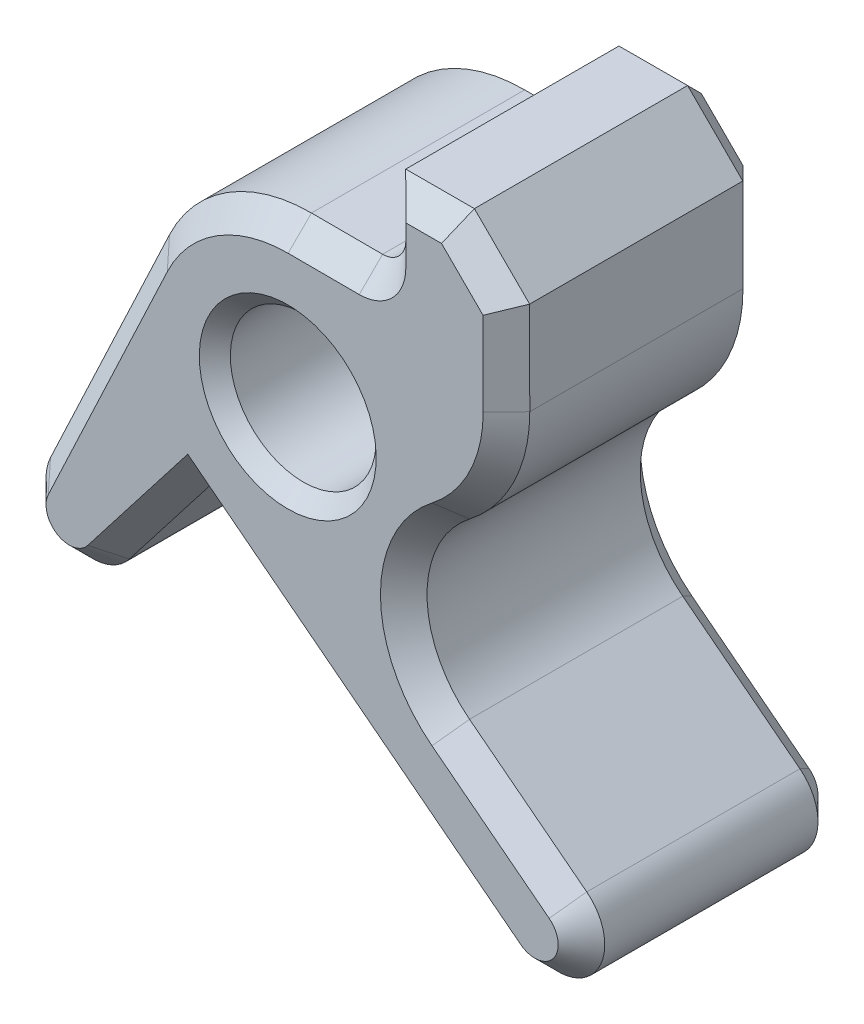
ISO-10303-21;
HEADER;
FILE_DESCRIPTION(('STEP AP214'),'2;1');
FILE_NAME('part.step','',(''),(''),'','','');
FILE_SCHEMA(('AUTOMOTIVE_DESIGN { 1 0 10303 214 1 1 1 1 }'));
ENDSEC;
DATA;
#1=APPLICATION_CONTEXT('core data for automotive mechanical design processes');
#2=APPLICATION_PROTOCOL_DEFINITION('international standard','automotive_design',2000,#1);
#3=PRODUCT_CONTEXT('',#1,'mechanical');
#4=PRODUCT('Part','Part','',(#3));
#5=PRODUCT_RELATED_PRODUCT_CATEGORY('part','',(#4));
#6=PRODUCT_DEFINITION_FORMATION('','',#4);
#7=PRODUCT_DEFINITION_CONTEXT('part definition',#1,'design');
#8=PRODUCT_DEFINITION('design','',#6,#7);
#9=PRODUCT_DEFINITION_SHAPE('','',#8);
#10=(LENGTH_UNIT() NAMED_UNIT(*) SI_UNIT(.MILLI.,.METRE.));
#11=(NAMED_UNIT(*) PLANE_ANGLE_UNIT() SI_UNIT($,.RADIAN.));
#12=(NAMED_UNIT(*) SI_UNIT($,.STERADIAN.) SOLID_ANGLE_UNIT());
#13=UNCERTAINTY_MEASURE_WITH_UNIT(LENGTH_MEASURE(1.E-05),#10,'distance_accuracy_value','');
#14=(GEOMETRIC_REPRESENTATION_CONTEXT(3) GLOBAL_UNCERTAINTY_ASSIGNED_CONTEXT((#13)) GLOBAL_UNIT_ASSIGNED_CONTEXT((#10,
#11,#12)) REPRESENTATION_CONTEXT('',''));
#15=CARTESIAN_POINT('',(0.,0.,0.));
#16=DIRECTION('',(0.,0.,1.));
#17=DIRECTION('',(1.,0.,0.));
#18=AXIS2_PLACEMENT_3D('',#15,#16,#17);
#19=CARTESIAN_POINT('',(2.59566422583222,6.58574384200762,-8.08457451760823));
#20=DIRECTION('',(0.,-6.10849912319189E-13,1.));
#21=DIRECTION('',(0.,-1.,-6.10849912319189E-13));
#22=AXIS2_PLACEMENT_3D('',#19,#20,#21);
#23=PLANE('',#22);
#24=CARTESIAN_POINT('',(2.92793160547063,10.1122925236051,-8.08457451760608));
#25=DIRECTION('',(0.,-6.10849912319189E-13,1.));
#26=DIRECTION('',(0.,-1.,-6.10849912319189E-13));
#27=AXIS2_PLACEMENT_3D('',#24,#25,#26);
#28=CIRCLE('',#27,1.90108833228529);
#29=CARTESIAN_POINT('',(2.92284987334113,8.21121098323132,-8.08457451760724));
#30=VERTEX_POINT('',#29);
#31=CARTESIAN_POINT('',(4.82901793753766,10.1150502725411,-8.08457451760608));
#32=VERTEX_POINT('',#31);
#33=EDGE_CURVE('E607',#30,#32,#28,.T.);
#34=ORIENTED_EDGE('',*,*,#33,.T.);
#35=DIRECTION('',(-0.00145061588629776,0.999998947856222,6.10849269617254E-13));
#36=VECTOR('',#35,1.);
#37=CARTESIAN_POINT('',(4.83413290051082,6.58899100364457,-8.08457451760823));
#38=LINE('',#37,#36);
#39=CARTESIAN_POINT('',(4.82671508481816,11.7025486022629,-8.08457451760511));
#40=VERTEX_POINT('',#39);
#41=EDGE_CURVE('E610',#32,#40,#38,.T.);
#42=ORIENTED_EDGE('',*,*,#41,.T.);
#43=DIRECTION('',(0.999998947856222,0.00145061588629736,0.));
#44=VECTOR('',#43,1.);
#45=CARTESIAN_POINT('',(2.58824641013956,11.6993014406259,-8.08457451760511));
#46=LINE('',#45,#44);
#47=CARTESIAN_POINT('',(6.28764512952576,11.7046678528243,-8.08457451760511));
#48=VERTEX_POINT('',#47);
#49=EDGE_CURVE('E595',#40,#48,#46,.T.);
#50=ORIENTED_EDGE('',*,*,#49,.T.);
#51=DIRECTION('',(0.708131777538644,-0.70608029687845,-4.31309087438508E-13));
#52=VECTOR('',#51,1.);
#53=CARTESIAN_POINT('',(6.99575027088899,10.9986141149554,-8.08457451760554));
#54=LINE('',#53,#52);
#55=CARTESIAN_POINT('',(7.98820401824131,10.0090355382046,-8.08457451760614));
#56=VERTEX_POINT('',#55);
#57=EDGE_CURVE('E589',#48,#56,#54,.T.);
#58=ORIENTED_EDGE('',*,*,#57,.T.);
#59=DIRECTION('',(0.00145061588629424,-0.999998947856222,-6.10849269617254E-13));
#60=VECTOR('',#59,1.);
#61=CARTESIAN_POINT('',(7.993158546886,6.59357354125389,-8.08457451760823));
#62=LINE('',#61,#60);
#63=CARTESIAN_POINT('',(7.993158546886,6.59357354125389,-8.08457451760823));
#64=VERTEX_POINT('',#63);
#65=EDGE_CURVE('E240',#56,#64,#62,.T.);
#66=ORIENTED_EDGE('',*,*,#65,.T.);
#67=CARTESIAN_POINT('',(2.59566422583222,6.58574384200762,-8.08457451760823));
#68=DIRECTION('',(0.,-6.10849912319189E-13,1.));
#69=DIRECTION('',(0.,-1.,-6.10849912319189E-13));
#70=AXIS2_PLACEMENT_3D('',#67,#68,#69);
#71=CIRCLE('',#70,5.39749999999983);
#72=CARTESIAN_POINT('',(5.90056152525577,2.31834884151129,-8.08457451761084));
#73=VERTEX_POINT('',#72);
#74=EDGE_CURVE('E233',#64,#73,#71,.F.);
#75=ORIENTED_EDGE('',*,*,#74,.T.);
#76=CARTESIAN_POINT('',(9.23204825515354,-1.98337932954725,-8.08457451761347));
#77=DIRECTION('',(0.,-6.10849912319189E-13,1.));
#78=DIRECTION('',(0.,-1.,-6.10849912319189E-13));
#79=AXIS2_PLACEMENT_3D('',#76,#77,#78);
#80=CIRCLE('',#79,5.44092538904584);
#81=CARTESIAN_POINT('',(5.89811966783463,-6.28321528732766,-8.08457451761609));
#82=VERTEX_POINT('',#81);
#83=EDGE_CURVE('E236',#73,#82,#80,.T.);
#84=ORIENTED_EDGE('',*,*,#83,.T.);
#85=DIRECTION('',(0.790276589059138,-0.612750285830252,-3.74298458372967E-13));
#86=VECTOR('',#85,1.);
#87=CARTESIAN_POINT('',(-2.39607939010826,0.14778989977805,-8.08457451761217));
#88=LINE('',#87,#86);
#89=CARTESIAN_POINT('',(10.6917339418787,-10.0000007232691,-8.08457451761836));
#90=VERTEX_POINT('',#89);
#91=EDGE_CURVE('E247',#82,#90,#88,.T.);
#92=ORIENTED_EDGE('',*,*,#91,.T.);
#93=CARTESIAN_POINT('',(10.1080892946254,-10.7527391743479,-8.08457451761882));
#94=DIRECTION('',(0.,-6.10849912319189E-13,1.));
#95=DIRECTION('',(0.,-1.,-6.10849912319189E-13));
#96=AXIS2_PLACEMENT_3D('',#93,#94,#95);
#97=CIRCLE('',#96,0.952500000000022);
#98=CARTESIAN_POINT('',(9.52444464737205,-11.5054776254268,-8.08457451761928));
#99=VERTEX_POINT('',#98);
#100=EDGE_CURVE('E246',#90,#99,#97,.F.);
#101=ORIENTED_EDGE('',*,*,#100,.T.);
#102=DIRECTION('',(-0.790276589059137,0.612750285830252,3.74298458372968E-13));
#103=VECTOR('',#102,1.);
#104=CARTESIAN_POINT('',(-3.56336868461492,-1.35768700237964,-8.08457451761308));
#105=LINE('',#104,#103);
#106=CARTESIAN_POINT('',(-4.09040764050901,-0.949041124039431,-8.08457451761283));
#107=VERTEX_POINT('',#106);
#108=EDGE_CURVE('E525',#99,#107,#105,.T.);
#109=ORIENTED_EDGE('',*,*,#108,.T.);
#110=DIRECTION('',(-0.612750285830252,-0.790276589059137,-4.82740385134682E-13));
#111=VECTOR('',#110,1.);
#112=CARTESIAN_POINT('',(2.06862526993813,6.99438972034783,-8.08457451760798));
#113=LINE('',#112,#111);
#114=CARTESIAN_POINT('',(-8.18160240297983,-6.22553877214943,-8.08457451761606));
#115=VERTEX_POINT('',#114);
#116=EDGE_CURVE('E586',#107,#115,#113,.T.);
#117=ORIENTED_EDGE('',*,*,#116,.T.);
#118=CARTESIAN_POINT('',(-8.93434085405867,-5.64189412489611,-8.0845745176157));
#119=DIRECTION('',(0.,-6.10849912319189E-13,1.));
#120=DIRECTION('',(0.,-1.,-6.10849912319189E-13));
#121=AXIS2_PLACEMENT_3D('',#118,#119,#120);
#122=CIRCLE('',#121,0.952500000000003);
#123=CARTESIAN_POINT('',(-9.79593798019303,-5.23580713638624,-8.08457451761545));
#124=VERTEX_POINT('',#123);
#125=EDGE_CURVE('E592',#115,#124,#122,.F.);
#126=ORIENTED_EDGE('',*,*,#125,.T.);
#127=DIRECTION('',(0.426338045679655,0.904563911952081,5.52552786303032E-13));
#128=VECTOR('',#127,1.);
#129=CARTESIAN_POINT('',(-2.9846079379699,9.21583144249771,-8.08457451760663));
#130=LINE('',#129,#128);
#131=CARTESIAN_POINT('',(-4.92718676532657,5.09425064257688,-8.08457451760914));
#132=VERTEX_POINT('',#131);
#133=EDGE_CURVE('E598',#124,#132,#130,.T.);
#134=ORIENTED_EDGE('',*,*,#133,.T.);
#135=CARTESIAN_POINT('',(0.,2.7719745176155,-8.08457451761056));
#136=DIRECTION('',(0.,-6.10849912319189E-13,1.));
#137=DIRECTION('',(0.,-1.,-6.10849912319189E-13));
#138=AXIS2_PLACEMENT_3D('',#135,#136,#137);
#139=CIRCLE('',#138,5.44703000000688);
#140=CARTESIAN_POINT('',(0.0145602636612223,8.21898505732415,-8.08457451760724));
#141=VERTEX_POINT('',#140);
#142=EDGE_CURVE('E601',#132,#141,#139,.F.);
#143=ORIENTED_EDGE('',*,*,#142,.T.);
#144=DIRECTION('',(0.999996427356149,-0.00267306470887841,0.));
#145=VECTOR('',#144,1.);
#146=CARTESIAN_POINT('',(2.60001152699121,8.2120739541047,-8.08457451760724));
#147=LINE('',#146,#145);
#148=EDGE_CURVE('E604',#141,#30,#147,.T.);
#149=ORIENTED_EDGE('',*,*,#148,.T.);
#150=EDGE_LOOP('',(#34,#42,#50,#58,#66,#75,#84,#92,#101,#109,#117,#126,#134,#143,#149));
#151=FACE_BOUND('',#150,.T.);
#152=CARTESIAN_POINT('',(0.,2.7719745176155,-8.08457451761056));
#153=DIRECTION('',(0.,-6.10849912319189E-13,1.));
#154=DIRECTION('',(0.,-1.,-6.10849912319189E-13));
#155=AXIS2_PLACEMENT_3D('',#152,#153,#154);
#156=CIRCLE('',#155,3.6175);
#157=CARTESIAN_POINT('',(0.,-0.845525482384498,-8.08457451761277));
#158=VERTEX_POINT('',#157);
#159=EDGE_CURVE('E571',#158,#158,#156,.T.);
#160=ORIENTED_EDGE('',*,*,#159,.T.);
#161=EDGE_LOOP('',(#160));
#162=FACE_BOUND('',#161,.T.);
#163=ADVANCED_FACE('F39',(#151,#162),#23,.F.);
#164=CARTESIAN_POINT('',(2.59566422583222,6.58574384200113,2.54062548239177));
#165=DIRECTION('',(0.,-6.10849912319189E-13,1.));
#166=DIRECTION('',(0.,-1.,-6.10849912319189E-13));
#167=AXIS2_PLACEMENT_3D('',#164,#165,#166);
#168=PLANE('',#167);
#169=DIRECTION('',(0.00145061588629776,-0.999998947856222,-6.10849269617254E-13));
#170=VECTOR('',#169,1.);
#171=CARTESIAN_POINT('',(4.82901793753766,10.1150502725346,2.54062548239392));
#172=LINE('',#171,#170);
#173=CARTESIAN_POINT('',(4.82671508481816,11.7025486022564,2.54062548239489));
#174=VERTEX_POINT('',#173);
#175=CARTESIAN_POINT('',(4.82901793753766,10.1150502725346,2.54062548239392));
#176=VERTEX_POINT('',#175);
#177=EDGE_CURVE('E455',#174,#176,#172,.T.);
#178=ORIENTED_EDGE('',*,*,#177,.T.);
#179=CARTESIAN_POINT('',(2.92793160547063,10.1122925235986,2.54062548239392));
#180=DIRECTION('',(0.,-6.10849912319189E-13,1.));
#181=DIRECTION('',(0.,-1.,-6.10849912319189E-13));
#182=AXIS2_PLACEMENT_3D('',#179,#180,#181);
#183=CIRCLE('',#182,1.90108833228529);
#184=CARTESIAN_POINT('',(2.92284987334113,8.21121098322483,2.54062548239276));
#185=VERTEX_POINT('',#184);
#186=EDGE_CURVE('E11',#176,#185,#183,.F.);
#187=ORIENTED_EDGE('',*,*,#186,.T.);
#188=DIRECTION('',(-0.999996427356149,0.00267306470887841,0.));
#189=VECTOR('',#188,1.);
#190=CARTESIAN_POINT('',(0.0145602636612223,8.21898505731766,2.54062548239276));
#191=LINE('',#190,#189);
#192=CARTESIAN_POINT('',(0.0145602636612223,8.21898505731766,2.54062548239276));
#193=VERTEX_POINT('',#192);
#194=EDGE_CURVE('E49',#185,#193,#191,.T.);
#195=ORIENTED_EDGE('',*,*,#194,.T.);
#196=CARTESIAN_POINT('',(0.,2.77197451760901,2.54062548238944));
#197=DIRECTION('',(0.,-6.10849912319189E-13,1.));
#198=DIRECTION('',(0.,-1.,-6.10849912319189E-13));
#199=AXIS2_PLACEMENT_3D('',#196,#197,#198);
#200=CIRCLE('',#199,5.44703000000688);
#201=CARTESIAN_POINT('',(-4.92718676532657,5.09425064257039,2.54062548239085));
#202=VERTEX_POINT('',#201);
#203=EDGE_CURVE('E461',#193,#202,#200,.T.);
#204=ORIENTED_EDGE('',*,*,#203,.T.);
#205=DIRECTION('',(-0.426338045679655,-0.904563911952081,-5.52552786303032E-13));
#206=VECTOR('',#205,1.);
#207=CARTESIAN_POINT('',(-9.79593798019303,-5.23580713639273,2.54062548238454));
#208=LINE('',#207,#206);
#209=CARTESIAN_POINT('',(-9.79593798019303,-5.23580713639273,2.54062548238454));
#210=VERTEX_POINT('',#209);
#211=EDGE_CURVE('E458',#202,#210,#208,.T.);
#212=ORIENTED_EDGE('',*,*,#211,.T.);
#213=CARTESIAN_POINT('',(-8.93434085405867,-5.6418941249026,2.5406254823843));
#214=DIRECTION('',(0.,-6.10849912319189E-13,1.));
#215=DIRECTION('',(0.,-1.,-6.10849912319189E-13));
#216=AXIS2_PLACEMENT_3D('',#213,#214,#215);
#217=CIRCLE('',#216,0.9525);
#218=CARTESIAN_POINT('',(-8.18160240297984,-6.22553877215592,2.54062548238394));
#219=VERTEX_POINT('',#218);
#220=EDGE_CURVE('E452',#210,#219,#217,.T.);
#221=ORIENTED_EDGE('',*,*,#220,.T.);
#222=DIRECTION('',(0.612750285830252,0.790276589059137,4.82740385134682E-13));
#223=VECTOR('',#222,1.);
#224=CARTESIAN_POINT('',(-4.67405228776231,-1.70177957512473,2.5406254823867));
#225=LINE('',#224,#223);
#226=CARTESIAN_POINT('',(-4.09040764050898,-0.949041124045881,2.54062548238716));
#227=VERTEX_POINT('',#226);
#228=EDGE_CURVE('E442',#219,#227,#225,.T.);
#229=ORIENTED_EDGE('',*,*,#228,.T.);
#230=DIRECTION('',(0.790276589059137,-0.612750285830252,-3.74298458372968E-13));
#231=VECTOR('',#230,1.);
#232=CARTESIAN_POINT('',(9.52444464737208,-11.5054776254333,2.54062548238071));
#233=LINE('',#232,#231);
#234=CARTESIAN_POINT('',(9.52444464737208,-11.5054776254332,2.54062548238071));
#235=VERTEX_POINT('',#234);
#236=EDGE_CURVE('E439',#227,#235,#233,.T.);
#237=ORIENTED_EDGE('',*,*,#236,.T.);
#238=CARTESIAN_POINT('',(10.1080892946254,-10.7527391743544,2.54062548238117));
#239=DIRECTION('',(0.,-6.10849912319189E-13,1.));
#240=DIRECTION('',(0.,-1.,-6.10849912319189E-13));
#241=AXIS2_PLACEMENT_3D('',#238,#239,#240);
#242=CIRCLE('',#241,0.952499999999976);
#243=CARTESIAN_POINT('',(10.6917339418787,-10.0000007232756,2.54062548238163));
#244=VERTEX_POINT('',#243);
#245=EDGE_CURVE('E436',#235,#244,#242,.T.);
#246=ORIENTED_EDGE('',*,*,#245,.T.);
#247=DIRECTION('',(-0.790276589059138,0.612750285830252,3.74298458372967E-13));
#248=VECTOR('',#247,1.);
#249=CARTESIAN_POINT('',(5.8981196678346,-6.28321528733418,2.5406254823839));
#250=LINE('',#249,#248);
#251=CARTESIAN_POINT('',(5.8981196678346,-6.28321528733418,2.5406254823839));
#252=VERTEX_POINT('',#251);
#253=EDGE_CURVE('E433',#244,#252,#250,.T.);
#254=ORIENTED_EDGE('',*,*,#253,.T.);
#255=CARTESIAN_POINT('',(9.23204825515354,-1.98337932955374,2.54062548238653));
#256=DIRECTION('',(0.,-6.10849912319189E-13,1.));
#257=DIRECTION('',(0.,-1.,-6.10849912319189E-13));
#258=AXIS2_PLACEMENT_3D('',#255,#256,#257);
#259=CIRCLE('',#258,5.44092538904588);
#260=CARTESIAN_POINT('',(5.90056152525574,2.31834884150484,2.54062548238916));
#261=VERTEX_POINT('',#260);
#262=EDGE_CURVE('E427',#252,#261,#259,.F.);
#263=ORIENTED_EDGE('',*,*,#262,.T.);
#264=CARTESIAN_POINT('',(2.59566422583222,6.58574384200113,2.54062548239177));
#265=DIRECTION('',(0.,-6.10849912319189E-13,1.));
#266=DIRECTION('',(0.,-1.,-6.10849912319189E-13));
#267=AXIS2_PLACEMENT_3D('',#264,#265,#266);
#268=CIRCLE('',#267,5.39749999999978);
#269=CARTESIAN_POINT('',(7.99315854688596,6.5935735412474,2.54062548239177));
#270=VERTEX_POINT('',#269);
#271=EDGE_CURVE('E424',#261,#270,#268,.T.);
#272=ORIENTED_EDGE('',*,*,#271,.T.);
#273=DIRECTION('',(-0.00145061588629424,0.999998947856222,6.10849269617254E-13));
#274=VECTOR('',#273,1.);
#275=CARTESIAN_POINT('',(7.98763169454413,10.4035735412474,2.5406254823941));
#276=LINE('',#275,#274);
#277=CARTESIAN_POINT('',(7.98820401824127,10.0090355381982,2.54062548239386));
#278=VERTEX_POINT('',#277);
#279=EDGE_CURVE('E430',#270,#278,#276,.T.);
#280=ORIENTED_EDGE('',*,*,#279,.T.);
#281=DIRECTION('',(-0.708131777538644,0.70608029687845,4.31309087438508E-13));
#282=VECTOR('',#281,1.);
#283=CARTESIAN_POINT('',(6.00825993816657,11.9832436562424,2.54062548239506));
#284=LINE('',#283,#282);
#285=CARTESIAN_POINT('',(6.28764512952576,11.7046678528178,2.54062548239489));
#286=VERTEX_POINT('',#285);
#287=EDGE_CURVE('E445',#278,#286,#284,.T.);
#288=ORIENTED_EDGE('',*,*,#287,.T.);
#289=DIRECTION('',(-0.999998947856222,-0.00145061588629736,0.));
#290=VECTOR('',#289,1.);
#291=CARTESIAN_POINT('',(3.87421608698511,11.7011668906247,2.54062548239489));
#292=LINE('',#291,#290);
#293=EDGE_CURVE('E448',#286,#174,#292,.T.);
#294=ORIENTED_EDGE('',*,*,#293,.T.);
#295=EDGE_LOOP('',(#178,#187,#195,#204,#212,#221,#229,#237,#246,#254,#263,#272,#280,#288,#294));
#296=FACE_BOUND('',#295,.T.);
#297=CARTESIAN_POINT('',(0.,2.77197451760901,2.54062548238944));
#298=DIRECTION('',(0.,-6.10849912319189E-13,1.));
#299=DIRECTION('',(0.,-1.,-6.10849912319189E-13));
#300=AXIS2_PLACEMENT_3D('',#297,#298,#299);
#301=CIRCLE('',#300,3.6175);
#302=CARTESIAN_POINT('',(0.,-0.845525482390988,2.54062548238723));
#303=VERTEX_POINT('',#302);
#304=EDGE_CURVE('E259',#303,#303,#301,.F.);
#305=ORIENTED_EDGE('',*,*,#304,.T.);
#306=EDGE_LOOP('',(#305));
#307=FACE_BOUND('',#306,.T.);
#308=ADVANCED_FACE('F465',(#296,#307),#168,.T.);
#309=CARTESIAN_POINT('',(3.87283437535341,12.6536658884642,-8.08457451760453));
#310=DIRECTION('',(0.00145061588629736,-0.999998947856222,-6.10849269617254E-13));
#311=DIRECTION('',(-0.999998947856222,-0.00145061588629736,0.));
#312=AXIS2_PLACEMENT_3D('',#309,#310,#311);
#313=PLANE('',#312);
#314=DIRECTION('',(0.,-6.10849912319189E-13,1.));
#315=VECTOR('',#314,1.);
#316=CARTESIAN_POINT('',(6.6808014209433,12.6577391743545,-8.08457451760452));
#317=LINE('',#316,#315);
#318=CARTESIAN_POINT('',(6.6808014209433,12.6577391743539,-7.13207451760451));
#319=VERTEX_POINT('',#318);
#320=CARTESIAN_POINT('',(6.6808014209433,12.6577391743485,1.58812548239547));
#321=VERTEX_POINT('',#320);
#322=EDGE_CURVE('E559',#319,#321,#317,.T.);
#323=ORIENTED_EDGE('',*,*,#322,.F.);
#324=DIRECTION('',(-0.999998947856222,-0.00145061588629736,0.));
#325=VECTOR('',#324,1.);
#326=CARTESIAN_POINT('',(3.87283437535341,12.6536658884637,-7.13207451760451));
#327=LINE('',#326,#325);
#328=CARTESIAN_POINT('',(3.87283437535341,12.6536658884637,-7.13207451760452));
#329=VERTEX_POINT('',#328);
#330=EDGE_CURVE('E624',#319,#329,#327,.T.);
#331=ORIENTED_EDGE('',*,*,#330,.T.);
#332=DIRECTION('',(0.,-6.10849912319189E-13,1.));
#333=VECTOR('',#332,1.);
#334=CARTESIAN_POINT('',(3.87283437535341,12.6536658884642,-8.08457451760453));
#335=LINE('',#334,#333);
#336=CARTESIAN_POINT('',(3.87283437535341,12.6536658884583,1.58812548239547));
#337=VERTEX_POINT('',#336);
#338=EDGE_CURVE('E310',#329,#337,#335,.T.);
#339=ORIENTED_EDGE('',*,*,#338,.T.);
#340=DIRECTION('',(0.999998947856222,0.00145061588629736,0.));
#341=VECTOR('',#340,1.);
#342=CARTESIAN_POINT('',(6.6808014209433,12.6577391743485,1.58812548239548));
#343=LINE('',#342,#341);
#344=EDGE_CURVE('E620',#337,#321,#343,.T.);
#345=ORIENTED_EDGE('',*,*,#344,.T.);
#346=EDGE_LOOP('',(#323,#331,#339,#345));
#347=FACE_BOUND('',#346,.T.);
#348=ADVANCED_FACE('F794',(#347),#313,.F.);
#349=CARTESIAN_POINT('',(6.6808014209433,12.6577391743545,-8.08457451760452));
#350=DIRECTION('',(-0.70608029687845,-0.708131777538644,-4.32562234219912E-13));
#351=DIRECTION('',(-0.708131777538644,0.70608029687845,4.31309087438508E-13));
#352=AXIS2_PLACEMENT_3D('',#349,#350,#351);
#353=PLANE('',#352);
#354=DIRECTION('',(0.,-6.10849912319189E-13,1.));
#355=VECTOR('',#354,1.);
#356=CARTESIAN_POINT('',(8.94013069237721,10.4049552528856,-8.0845745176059));
#357=LINE('',#356,#355);
#358=CARTESIAN_POINT('',(8.94013069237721,10.404955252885,-7.13207451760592));
#359=VERTEX_POINT('',#358);
#360=CARTESIAN_POINT('',(8.94013069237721,10.4049552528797,1.58812548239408));
#361=VERTEX_POINT('',#360);
#362=EDGE_CURVE('E556',#359,#361,#357,.T.);
#363=ORIENTED_EDGE('',*,*,#362,.F.);
#364=DIRECTION('',(-0.708131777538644,0.70608029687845,4.31309087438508E-13));
#365=VECTOR('',#364,1.);
#366=CARTESIAN_POINT('',(6.6808014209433,12.6577391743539,-7.13207451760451));
#367=LINE('',#366,#365);
#368=EDGE_CURVE('E616',#359,#319,#367,.T.);
#369=ORIENTED_EDGE('',*,*,#368,.T.);
#370=ORIENTED_EDGE('',*,*,#322,.T.);
#371=DIRECTION('',(0.708131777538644,-0.70608029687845,-4.31309087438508E-13));
#372=VECTOR('',#371,1.);
#373=CARTESIAN_POINT('',(8.94013069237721,10.4049552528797,1.5881254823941));
#374=LINE('',#373,#372);
#375=EDGE_CURVE('E613',#321,#361,#374,.T.);
#376=ORIENTED_EDGE('',*,*,#375,.T.);
#377=EDGE_LOOP('',(#363,#369,#370,#376));
#378=FACE_BOUND('',#377,.T.);
#379=ADVANCED_FACE('F831',(#378),#353,.F.);
#380=CARTESIAN_POINT('',(8.94013069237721,10.4049552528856,-8.0845745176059));
#381=DIRECTION('',(-0.999998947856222,-0.00145061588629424,0.));
#382=DIRECTION('',(-0.00145061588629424,0.999998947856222,6.10849269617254E-13));
#383=AXIS2_PLACEMENT_3D('',#380,#381,#382);
#384=PLANE('',#383);
#385=DIRECTION('',(0.,-6.10849912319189E-13,1.));
#386=VECTOR('',#385,1.);
#387=CARTESIAN_POINT('',(8.94565754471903,6.59495525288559,-8.08457451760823));
#388=LINE('',#387,#386);
#389=CARTESIAN_POINT('',(8.94565754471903,6.59495525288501,-7.13207451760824));
#390=VERTEX_POINT('',#389);
#391=CARTESIAN_POINT('',(8.94565754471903,6.59495525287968,1.58812548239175));
#392=VERTEX_POINT('',#391);
#393=EDGE_CURVE('E549',#390,#392,#388,.T.);
#394=ORIENTED_EDGE('',*,*,#393,.F.);
#395=DIRECTION('',(-0.00145061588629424,0.999998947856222,6.10849269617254E-13));
#396=VECTOR('',#395,1.);
#397=CARTESIAN_POINT('',(8.94013069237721,10.404955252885,-7.13207451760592));
#398=LINE('',#397,#396);
#399=EDGE_CURVE('E388',#390,#359,#398,.T.);
#400=ORIENTED_EDGE('',*,*,#399,.T.);
#401=ORIENTED_EDGE('',*,*,#362,.T.);
#402=DIRECTION('',(0.00145061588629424,-0.999998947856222,-6.10849269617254E-13));
#403=VECTOR('',#402,1.);
#404=CARTESIAN_POINT('',(8.94565754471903,6.59495525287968,1.58812548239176));
#405=LINE('',#404,#403);
#406=EDGE_CURVE('E395',#361,#392,#405,.T.);
#407=ORIENTED_EDGE('',*,*,#406,.T.);
#408=EDGE_LOOP('',(#394,#400,#401,#407));
#409=FACE_BOUND('',#408,.T.);
#410=ADVANCED_FACE('F827',(#409),#384,.F.);
#411=CARTESIAN_POINT('',(2.59566422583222,6.58574384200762,-8.08457451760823));
#412=DIRECTION('',(0.,-6.10849912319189E-13,1.));
#413=DIRECTION('',(0.,-1.,-6.10849912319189E-13));
#414=AXIS2_PLACEMENT_3D('',#411,#412,#413);
#415=CYLINDRICAL_SURFACE('',#414,6.34999999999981);
#416=DIRECTION('',(0.,-6.10849912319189E-13,1.));
#417=VECTOR('',#416,1.);
#418=CARTESIAN_POINT('',(6.48377869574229,1.56527913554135,-8.0845745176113));
#419=LINE('',#418,#417);
#420=CARTESIAN_POINT('',(6.48377869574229,1.56527913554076,-7.13207451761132));
#421=VERTEX_POINT('',#420);
#422=CARTESIAN_POINT('',(6.48377869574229,1.56527913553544,1.58812548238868));
#423=VERTEX_POINT('',#422);
#424=EDGE_CURVE('E545',#421,#423,#419,.T.);
#425=ORIENTED_EDGE('',*,*,#424,.F.);
#426=CARTESIAN_POINT('',(2.59566422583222,6.58574384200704,-7.13207451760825));
#427=DIRECTION('',(0.,-6.11023334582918E-13,1.));
#428=DIRECTION('',(0.,-1.,-6.11023334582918E-13));
#429=AXIS2_PLACEMENT_3D('',#426,#427,#428);
#430=CIRCLE('',#429,6.34999999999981);
#431=EDGE_CURVE('E262',#421,#390,#430,.T.);
#432=ORIENTED_EDGE('',*,*,#431,.T.);
#433=ORIENTED_EDGE('',*,*,#393,.T.);
#434=CARTESIAN_POINT('',(2.59566422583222,6.58574384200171,1.58812548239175));
#435=DIRECTION('',(0.,-6.11023334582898E-13,1.));
#436=DIRECTION('',(0.,-1.,-6.11023334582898E-13));
#437=AXIS2_PLACEMENT_3D('',#434,#435,#436);
#438=CIRCLE('',#437,6.34999999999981);
#439=EDGE_CURVE('E407',#392,#423,#438,.F.);
#440=ORIENTED_EDGE('',*,*,#439,.T.);
#441=EDGE_LOOP('',(#425,#432,#433,#440));
#442=FACE_BOUND('',#441,.T.);
#443=ADVANCED_FACE('F824',(#442),#415,.T.);
#444=CARTESIAN_POINT('',(9.23204825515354,-1.98337932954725,-8.08457451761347));
#445=DIRECTION('',(0.,-6.10849912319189E-13,1.));
#446=DIRECTION('',(0.,-1.,-6.10849912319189E-13));
#447=AXIS2_PLACEMENT_3D('',#444,#445,#446);
#448=CYLINDRICAL_SURFACE('',#447,4.48842538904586);
#449=DIRECTION('',(0.,-6.10849912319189E-13,1.));
#450=VECTOR('',#449,1.);
#451=CARTESIAN_POINT('',(6.48176431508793,-5.53047683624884,-8.08457451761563));
#452=LINE('',#451,#450);
#453=CARTESIAN_POINT('',(6.48176431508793,-5.53047683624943,-7.13207451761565));
#454=VERTEX_POINT('',#453);
#455=CARTESIAN_POINT('',(6.48176431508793,-5.53047683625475,1.58812548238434));
#456=VERTEX_POINT('',#455);
#457=EDGE_CURVE('E537',#454,#456,#452,.T.);
#458=ORIENTED_EDGE('',*,*,#457,.F.);
#459=CARTESIAN_POINT('',(9.23204825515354,-1.98337932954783,-7.13207451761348));
#460=DIRECTION('',(0.,-6.11023334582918E-13,1.));
#461=DIRECTION('',(0.,-1.,-6.11023334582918E-13));
#462=AXIS2_PLACEMENT_3D('',#459,#460,#461);
#463=CIRCLE('',#462,4.48842538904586);
#464=EDGE_CURVE('E421',#454,#421,#463,.F.);
#465=ORIENTED_EDGE('',*,*,#464,.T.);
#466=ORIENTED_EDGE('',*,*,#424,.T.);
#467=CARTESIAN_POINT('',(9.23204825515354,-1.98337932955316,1.58812548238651));
#468=DIRECTION('',(0.,-6.11023334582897E-13,1.));
#469=DIRECTION('',(0.,-1.,-6.11023334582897E-13));
#470=AXIS2_PLACEMENT_3D('',#467,#468,#469);
#471=CIRCLE('',#470,4.48842538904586);
#472=EDGE_CURVE('E418',#423,#456,#471,.T.);
#473=ORIENTED_EDGE('',*,*,#472,.T.);
#474=EDGE_LOOP('',(#458,#465,#466,#473));
#475=FACE_BOUND('',#474,.T.);
#476=ADVANCED_FACE('F540',(#475),#448,.F.);
#477=CARTESIAN_POINT('',(11.275378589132,-9.24726227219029,-8.0845745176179));
#478=DIRECTION('',(-0.612750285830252,-0.790276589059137,-4.82740385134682E-13));
#479=DIRECTION('',(-0.790276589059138,0.612750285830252,3.74298458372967E-13));
#480=AXIS2_PLACEMENT_3D('',#477,#478,#479);
#481=PLANE('',#480);
#482=DIRECTION('',(0.,-6.10849912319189E-13,1.));
#483=VECTOR('',#482,1.);
#484=CARTESIAN_POINT('',(11.275378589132,-9.24726227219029,-8.0845745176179));
#485=LINE('',#484,#483);
#486=CARTESIAN_POINT('',(11.275378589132,-9.24726227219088,-7.13207451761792));
#487=VERTEX_POINT('',#486);
#488=CARTESIAN_POINT('',(11.275378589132,-9.2472622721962,1.58812548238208));
#489=VERTEX_POINT('',#488);
#490=EDGE_CURVE('E521',#487,#489,#485,.T.);
#491=ORIENTED_EDGE('',*,*,#490,.F.);
#492=DIRECTION('',(-0.790276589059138,0.612750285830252,3.74298458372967E-13));
#493=VECTOR('',#492,1.);
#494=CARTESIAN_POINT('',(11.275378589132,-9.24726227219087,-7.13207451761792));
#495=LINE('',#494,#493);
#496=EDGE_CURVE('E415',#487,#454,#495,.T.);
#497=ORIENTED_EDGE('',*,*,#496,.T.);
#498=ORIENTED_EDGE('',*,*,#457,.T.);
#499=DIRECTION('',(0.790276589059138,-0.612750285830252,-3.74298458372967E-13));
#500=VECTOR('',#499,1.);
#501=CARTESIAN_POINT('',(11.275378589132,-9.2472622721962,1.58812548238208));
#502=LINE('',#501,#500);
#503=EDGE_CURVE('E412',#456,#489,#502,.T.);
#504=ORIENTED_EDGE('',*,*,#503,.T.);
#505=EDGE_LOOP('',(#491,#497,#498,#504));
#506=FACE_BOUND('',#505,.T.);
#507=ADVANCED_FACE('F536',(#506),#481,.F.);
#508=CARTESIAN_POINT('',(10.1080892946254,-10.7527391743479,-8.08457451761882));
#509=DIRECTION('',(0.,-6.10849912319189E-13,1.));
#510=DIRECTION('',(0.,-1.,-6.10849912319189E-13));
#511=AXIS2_PLACEMENT_3D('',#508,#509,#510);
#512=CYLINDRICAL_SURFACE('',#511,1.905);
#513=DIRECTION('',(0.,-6.10849912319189E-13,1.));
#514=VECTOR('',#513,1.);
#515=CARTESIAN_POINT('',(8.94080000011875,-12.2582160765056,-8.08457451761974));
#516=LINE('',#515,#514);
#517=CARTESIAN_POINT('',(8.94080000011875,-12.2582160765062,-7.13207451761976));
#518=VERTEX_POINT('',#517);
#519=CARTESIAN_POINT('',(8.94080000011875,-12.2582160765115,1.58812548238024));
#520=VERTEX_POINT('',#519);
#521=EDGE_CURVE('E508',#518,#520,#516,.T.);
#522=ORIENTED_EDGE('',*,*,#521,.F.);
#523=CARTESIAN_POINT('',(10.1080892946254,-10.7527391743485,-7.13207451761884));
#524=DIRECTION('',(0.,-6.10112718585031E-13,1.));
#525=DIRECTION('',(0.,-1.,-6.10112718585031E-13));
#526=AXIS2_PLACEMENT_3D('',#523,#524,#525);
#527=CIRCLE('',#526,1.905);
#528=EDGE_CURVE('E399',#518,#487,#527,.T.);
#529=ORIENTED_EDGE('',*,*,#528,.T.);
#530=ORIENTED_EDGE('',*,*,#490,.T.);
#531=CARTESIAN_POINT('',(10.1080892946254,-10.7527391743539,1.58812548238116));
#532=DIRECTION('',(0.,-6.10112718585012E-13,1.));
#533=DIRECTION('',(0.,-1.,-6.10112718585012E-13));
#534=AXIS2_PLACEMENT_3D('',#531,#532,#533);
#535=CIRCLE('',#534,1.905);
#536=EDGE_CURVE('E394',#489,#520,#535,.F.);
#537=ORIENTED_EDGE('',*,*,#536,.T.);
#538=EDGE_LOOP('',(#522,#529,#530,#537));
#539=FACE_BOUND('',#538,.T.);
#540=ADVANCED_FACE('F515',(#539),#512,.T.);
#541=CARTESIAN_POINT('',(-3.92131383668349,-2.28542422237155,-8.08457451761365));
#542=DIRECTION('',(0.612750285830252,0.790276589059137,4.82740385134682E-13));
#543=DIRECTION('',(0.790276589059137,-0.612750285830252,-3.74298458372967E-13));
#544=AXIS2_PLACEMENT_3D('',#541,#542,#543);
#545=PLANE('',#544);
#546=DIRECTION('',(0.,-6.10849912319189E-13,1.));
#547=VECTOR('',#546,1.);
#548=CARTESIAN_POINT('',(-3.92131383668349,-2.28542422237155,-8.08457451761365));
#549=LINE('',#548,#547);
#550=CARTESIAN_POINT('',(-3.92131383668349,-2.28542422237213,-7.13207451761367));
#551=VERTEX_POINT('',#550);
#552=CARTESIAN_POINT('',(-3.92131383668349,-2.28542422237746,1.58812548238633));
#553=VERTEX_POINT('',#552);
#554=EDGE_CURVE('E510',#551,#553,#549,.T.);
#555=ORIENTED_EDGE('',*,*,#554,.F.);
#556=DIRECTION('',(0.790276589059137,-0.612750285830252,-3.74298458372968E-13));
#557=VECTOR('',#556,1.);
#558=CARTESIAN_POINT('',(-3.92131383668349,-2.28542422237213,-7.13207451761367));
#559=LINE('',#558,#557);
#560=EDGE_CURVE('E401',#551,#518,#559,.T.);
#561=ORIENTED_EDGE('',*,*,#560,.T.);
#562=ORIENTED_EDGE('',*,*,#521,.T.);
#563=DIRECTION('',(-0.790276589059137,0.612750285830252,3.74298458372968E-13));
#564=VECTOR('',#563,1.);
#565=CARTESIAN_POINT('',(-3.92131383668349,-2.28542422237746,1.58812548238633));
#566=LINE('',#565,#564);
#567=EDGE_CURVE('E499',#520,#553,#566,.T.);
#568=ORIENTED_EDGE('',*,*,#567,.T.);
#569=EDGE_LOOP('',(#555,#561,#562,#568));
#570=FACE_BOUND('',#569,.T.);
#571=ADVANCED_FACE('F507',(#570),#545,.F.);
#572=CARTESIAN_POINT('',(-3.92131383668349,-2.28542422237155,-8.08457451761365));
#573=DIRECTION('',(-0.790276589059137,0.612750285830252,3.74298458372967E-13));
#574=DIRECTION('',(0.612750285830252,0.790276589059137,4.82740385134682E-13));
#575=AXIS2_PLACEMENT_3D('',#572,#573,#574);
#576=PLANE('',#575);
#577=DIRECTION('',(0.,-6.10849912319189E-13,1.));
#578=VECTOR('',#577,1.);
#579=CARTESIAN_POINT('',(-7.42886395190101,-6.80918341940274,-8.08457451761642));
#580=LINE('',#579,#578);
#581=CARTESIAN_POINT('',(-7.42886395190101,-6.80918341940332,-7.13207451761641));
#582=VERTEX_POINT('',#581);
#583=CARTESIAN_POINT('',(-7.42886395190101,-6.80918341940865,1.58812548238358));
#584=VERTEX_POINT('',#583);
#585=EDGE_CURVE('E659',#582,#584,#580,.T.);
#586=ORIENTED_EDGE('',*,*,#585,.F.);
#587=DIRECTION('',(0.612750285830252,0.790276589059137,4.82740385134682E-13));
#588=VECTOR('',#587,1.);
#589=CARTESIAN_POINT('',(-3.92131383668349,-2.28542422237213,-7.13207451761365));
#590=LINE('',#589,#588);
#591=EDGE_CURVE('E642',#582,#551,#590,.T.);
#592=ORIENTED_EDGE('',*,*,#591,.T.);
#593=ORIENTED_EDGE('',*,*,#554,.T.);
#594=DIRECTION('',(-0.612750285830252,-0.790276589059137,-4.82740385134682E-13));
#595=VECTOR('',#594,1.);
#596=CARTESIAN_POINT('',(-7.42886395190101,-6.80918341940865,1.58812548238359));
#597=LINE('',#596,#595);
#598=EDGE_CURVE('E639',#553,#584,#597,.T.);
#599=ORIENTED_EDGE('',*,*,#598,.T.);
#600=EDGE_LOOP('',(#586,#592,#593,#599));
#601=FACE_BOUND('',#600,.T.);
#602=ADVANCED_FACE('F743',(#601),#576,.F.);
#603=CARTESIAN_POINT('',(-8.93434085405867,-5.64189412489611,-8.0845745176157));
#604=DIRECTION('',(0.,-6.10849912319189E-13,1.));
#605=DIRECTION('',(0.,-1.,-6.10849912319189E-13));
#606=AXIS2_PLACEMENT_3D('',#603,#604,#605);
#607=CYLINDRICAL_SURFACE('',#606,1.905);
#608=DIRECTION('',(0.,-6.10849912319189E-13,1.));
#609=VECTOR('',#608,1.);
#610=CARTESIAN_POINT('',(-10.6575351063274,-4.82972014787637,-8.08457451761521));
#611=LINE('',#610,#609);
#612=CARTESIAN_POINT('',(-10.6575351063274,-4.82972014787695,-7.1320745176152));
#613=VERTEX_POINT('',#612);
#614=CARTESIAN_POINT('',(-10.6575351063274,-4.82972014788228,1.58812548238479));
#615=VERTEX_POINT('',#614);
#616=EDGE_CURVE('E656',#613,#615,#611,.T.);
#617=ORIENTED_EDGE('',*,*,#616,.F.);
#618=CARTESIAN_POINT('',(-8.93434085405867,-5.64189412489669,-7.1320745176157));
#619=DIRECTION('',(0.,-6.11023334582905E-13,1.));
#620=DIRECTION('',(0.,-1.,-6.11023334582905E-13));
#621=AXIS2_PLACEMENT_3D('',#618,#619,#620);
#622=CIRCLE('',#621,1.905);
#623=EDGE_CURVE('E484',#613,#582,#622,.T.);
#624=ORIENTED_EDGE('',*,*,#623,.T.);
#625=ORIENTED_EDGE('',*,*,#585,.T.);
#626=CARTESIAN_POINT('',(-8.93434085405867,-5.64189412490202,1.5881254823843));
#627=DIRECTION('',(0.,-6.11023334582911E-13,1.));
#628=DIRECTION('',(0.,-1.,-6.11023334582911E-13));
#629=AXIS2_PLACEMENT_3D('',#626,#627,#628);
#630=CIRCLE('',#629,1.905);
#631=EDGE_CURVE('E490',#584,#615,#630,.F.);
#632=ORIENTED_EDGE('',*,*,#631,.T.);
#633=EDGE_LOOP('',(#617,#624,#625,#632));
#634=FACE_BOUND('',#633,.T.);
#635=ADVANCED_FACE('F655',(#634),#607,.T.);
#636=CARTESIAN_POINT('',(-10.6575351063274,-4.82972014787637,-8.08457451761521));
#637=DIRECTION('',(0.904563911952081,-0.426338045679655,-2.60428557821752E-13));
#638=DIRECTION('',(-0.426338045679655,-0.904563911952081,-5.52552786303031E-13));
#639=AXIS2_PLACEMENT_3D('',#636,#637,#638);
#640=PLANE('',#639);
#641=DIRECTION('',(0.,-6.10849912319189E-13,1.));
#642=VECTOR('',#641,1.);
#643=CARTESIAN_POINT('',(-5.78878389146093,5.50033763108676,-8.0845745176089));
#644=LINE('',#643,#642);
#645=CARTESIAN_POINT('',(-5.78878389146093,5.50033763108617,-7.13207451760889));
#646=VERTEX_POINT('',#645);
#647=CARTESIAN_POINT('',(-5.78878389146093,5.50033763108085,1.5881254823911));
#648=VERTEX_POINT('',#647);
#649=EDGE_CURVE('E665',#646,#648,#644,.T.);
#650=ORIENTED_EDGE('',*,*,#649,.F.);
#651=DIRECTION('',(-0.426338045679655,-0.904563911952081,-5.52552786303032E-13));
#652=VECTOR('',#651,1.);
#653=CARTESIAN_POINT('',(-10.6575351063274,-4.82972014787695,-7.1320745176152));
#654=LINE('',#653,#652);
#655=EDGE_CURVE('E496',#646,#613,#654,.T.);
#656=ORIENTED_EDGE('',*,*,#655,.T.);
#657=ORIENTED_EDGE('',*,*,#616,.T.);
#658=DIRECTION('',(0.426338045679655,0.904563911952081,5.52552786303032E-13));
#659=VECTOR('',#658,1.);
#660=CARTESIAN_POINT('',(-5.78878389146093,5.50033763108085,1.5881254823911));
#661=LINE('',#660,#659);
#662=EDGE_CURVE('E488',#615,#648,#661,.T.);
#663=ORIENTED_EDGE('',*,*,#662,.T.);
#664=EDGE_LOOP('',(#650,#656,#657,#663));
#665=FACE_BOUND('',#664,.T.);
#666=ADVANCED_FACE('F662',(#665),#640,.F.);
#667=CARTESIAN_POINT('',(0.,2.7719745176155,-8.08457451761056));
#668=DIRECTION('',(0.,-6.10849912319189E-13,1.));
#669=DIRECTION('',(0.,-1.,-6.10849912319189E-13));
#670=AXIS2_PLACEMENT_3D('',#667,#668,#669);
#671=CYLINDRICAL_SURFACE('',#670,6.39953000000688);
#672=DIRECTION('',(0.,-6.10849912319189E-13,1.));
#673=VECTOR('',#672,1.);
#674=CARTESIAN_POINT('',(0.017106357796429,9.17148165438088,-8.08457451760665));
#675=LINE('',#674,#673);
#676=CARTESIAN_POINT('',(0.017106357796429,9.1714816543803,-7.13207451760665));
#677=VERTEX_POINT('',#676);
#678=CARTESIAN_POINT('',(0.017106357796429,9.17148165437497,1.58812548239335));
#679=VERTEX_POINT('',#678);
#680=EDGE_CURVE('E722',#677,#679,#675,.T.);
#681=ORIENTED_EDGE('',*,*,#680,.F.);
#682=CARTESIAN_POINT('',(0.,2.77197451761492,-7.13207451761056));
#683=DIRECTION('',(0.,-6.11023334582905E-13,1.));
#684=DIRECTION('',(0.,-1.,-6.11023334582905E-13));
#685=AXIS2_PLACEMENT_3D('',#682,#683,#684);
#686=CIRCLE('',#685,6.39953000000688);
#687=EDGE_CURVE('E483',#677,#646,#686,.T.);
#688=ORIENTED_EDGE('',*,*,#687,.T.);
#689=ORIENTED_EDGE('',*,*,#649,.T.);
#690=CARTESIAN_POINT('',(0.,2.7719745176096,1.58812548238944));
#691=DIRECTION('',(0.,-6.1102333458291E-13,1.));
#692=DIRECTION('',(0.,-1.,-6.1102333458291E-13));
#693=AXIS2_PLACEMENT_3D('',#690,#691,#692);
#694=CIRCLE('',#693,6.39953000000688);
#695=EDGE_CURVE('E476',#648,#679,#694,.F.);
#696=ORIENTED_EDGE('',*,*,#695,.T.);
#697=EDGE_LOOP('',(#681,#688,#689,#696));
#698=FACE_BOUND('',#697,.T.);
#699=ADVANCED_FACE('F807',(#698),#671,.T.);
#700=CARTESIAN_POINT('',(2.92539596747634,9.16370758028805,-8.08457451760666));
#701=DIRECTION('',(-0.00267306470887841,-0.999996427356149,-6.10847729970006E-13));
#702=DIRECTION('',(-0.999996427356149,0.00267306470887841,0.));
#703=AXIS2_PLACEMENT_3D('',#700,#701,#702);
#704=PLANE('',#703);
#705=DIRECTION('',(0.,-6.10849912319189E-13,1.));
#706=VECTOR('',#705,1.);
#707=CARTESIAN_POINT('',(2.92539596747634,9.16370758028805,-8.08457451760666));
#708=LINE('',#707,#706);
#709=CARTESIAN_POINT('',(2.92539596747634,9.16370758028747,-7.13207451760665));
#710=VERTEX_POINT('',#709);
#711=CARTESIAN_POINT('',(2.92539596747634,9.16370758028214,1.58812548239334));
#712=VERTEX_POINT('',#711);
#713=EDGE_CURVE('E720',#710,#712,#708,.T.);
#714=ORIENTED_EDGE('',*,*,#713,.F.);
#715=DIRECTION('',(-0.999996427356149,0.00267306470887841,0.));
#716=VECTOR('',#715,1.);
#717=CARTESIAN_POINT('',(2.92539596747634,9.16370758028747,-7.13207451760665));
#718=LINE('',#717,#716);
#719=EDGE_CURVE('E648',#710,#677,#718,.T.);
#720=ORIENTED_EDGE('',*,*,#719,.T.);
#721=ORIENTED_EDGE('',*,*,#680,.T.);
#722=DIRECTION('',(0.999996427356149,-0.00267306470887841,0.));
#723=VECTOR('',#722,1.);
#724=CARTESIAN_POINT('',(2.92539596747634,9.16370758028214,1.58812548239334));
#725=LINE('',#724,#723);
#726=EDGE_CURVE('E645',#679,#712,#725,.T.);
#727=ORIENTED_EDGE('',*,*,#726,.T.);
#728=EDGE_LOOP('',(#714,#720,#721,#727));
#729=FACE_BOUND('',#728,.T.);
#730=ADVANCED_FACE('F719',(#729),#704,.F.);
#731=CARTESIAN_POINT('',(2.92793160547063,10.1122925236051,-8.08457451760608));
#732=DIRECTION('',(0.,-6.10849912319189E-13,1.));
#733=DIRECTION('',(0.,-1.,-6.10849912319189E-13));
#734=AXIS2_PLACEMENT_3D('',#731,#732,#733);
#735=CYLINDRICAL_SURFACE('',#734,0.948588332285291);
#736=DIRECTION('',(0.,-6.10849912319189E-13,1.));
#737=VECTOR('',#736,1.);
#738=CARTESIAN_POINT('',(3.87651893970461,10.1136685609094,-8.08457451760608));
#739=LINE('',#738,#737);
#740=CARTESIAN_POINT('',(3.87651893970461,10.1136685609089,-7.13207451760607));
#741=VERTEX_POINT('',#740);
#742=CARTESIAN_POINT('',(3.87651893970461,10.1136685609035,1.58812548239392));
#743=VERTEX_POINT('',#742);
#744=EDGE_CURVE('E729',#741,#743,#739,.T.);
#745=ORIENTED_EDGE('',*,*,#744,.F.);
#746=CARTESIAN_POINT('',(2.92793160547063,10.1122925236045,-7.13207451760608));
#747=DIRECTION('',(0.,-6.10112718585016E-13,1.));
#748=DIRECTION('',(0.,-1.,-6.10112718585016E-13));
#749=AXIS2_PLACEMENT_3D('',#746,#747,#748);
#750=CIRCLE('',#749,0.948588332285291);
#751=EDGE_CURVE('E636',#741,#710,#750,.F.);
#752=ORIENTED_EDGE('',*,*,#751,.T.);
#753=ORIENTED_EDGE('',*,*,#713,.T.);
#754=CARTESIAN_POINT('',(2.92793160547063,10.1122925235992,1.58812548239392));
#755=DIRECTION('',(0.,-6.1011271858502E-13,1.));
#756=DIRECTION('',(0.,-1.,-6.1011271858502E-13));
#757=AXIS2_PLACEMENT_3D('',#754,#755,#756);
#758=CIRCLE('',#757,0.948588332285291);
#759=EDGE_CURVE('E633',#712,#743,#758,.T.);
#760=ORIENTED_EDGE('',*,*,#759,.T.);
#761=EDGE_LOOP('',(#745,#752,#753,#760));
#762=FACE_BOUND('',#761,.T.);
#763=ADVANCED_FACE('F725',(#762),#735,.F.);
#764=CARTESIAN_POINT('',(3.87283437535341,12.6536658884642,-8.08457451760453));
#765=DIRECTION('',(0.999998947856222,0.00145061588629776,0.));
#766=DIRECTION('',(0.00145061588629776,-0.999998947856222,-6.10849269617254E-13));
#767=AXIS2_PLACEMENT_3D('',#764,#765,#766);
#768=PLANE('',#767);
#769=ORIENTED_EDGE('',*,*,#338,.F.);
#770=DIRECTION('',(0.00145061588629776,-0.999998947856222,-6.10849269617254E-13));
#771=VECTOR('',#770,1.);
#772=CARTESIAN_POINT('',(3.87283437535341,12.6536658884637,-7.13207451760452));
#773=LINE('',#772,#771);
#774=EDGE_CURVE('E630',#329,#741,#773,.T.);
#775=ORIENTED_EDGE('',*,*,#774,.T.);
#776=ORIENTED_EDGE('',*,*,#744,.T.);
#777=DIRECTION('',(-0.00145061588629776,0.999998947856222,6.10849269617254E-13));
#778=VECTOR('',#777,1.);
#779=CARTESIAN_POINT('',(3.87283437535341,12.6536658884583,1.58812548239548));
#780=LINE('',#779,#778);
#781=EDGE_CURVE('E627',#743,#337,#780,.T.);
#782=ORIENTED_EDGE('',*,*,#781,.T.);
#783=EDGE_LOOP('',(#769,#775,#776,#782));
#784=FACE_BOUND('',#783,.T.);
#785=ADVANCED_FACE('F799',(#784),#768,.F.);
#786=CARTESIAN_POINT('',(0.,2.7719745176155,-8.08457451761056));
#787=DIRECTION('',(0.,-6.10849912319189E-13,1.));
#788=DIRECTION('',(0.,-1.,-6.10849912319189E-13));
#789=AXIS2_PLACEMENT_3D('',#786,#787,#788);
#790=CYLINDRICAL_SURFACE('',#789,2.9825);
#791=CARTESIAN_POINT('',(0.,2.77197451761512,-7.44957451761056));
#792=DIRECTION('',(0.,-6.10849912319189E-13,1.));
#793=DIRECTION('',(0.,-1.,-6.10849912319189E-13));
#794=AXIS2_PLACEMENT_3D('',#791,#792,#793);
#795=CIRCLE('',#794,2.9825);
#796=CARTESIAN_POINT('',(0.,-0.210525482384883,-7.44957451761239));
#797=VERTEX_POINT('',#796);
#798=EDGE_CURVE('E567',#797,#797,#795,.F.);
#799=CARTESIAN_POINT('',(0.,2.7719745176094,1.90562548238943));
#800=DIRECTION('',(0.,-6.10849912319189E-13,1.));
#801=DIRECTION('',(0.,-1.,-6.10849912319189E-13));
#802=AXIS2_PLACEMENT_3D('',#799,#800,#801);
#803=CIRCLE('',#802,2.9825);
#804=CARTESIAN_POINT('',(0.,-0.210525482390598,1.90562548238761));
#805=VERTEX_POINT('',#804);
#806=EDGE_CURVE('E563',#805,#805,#803,.T.);
#807=CARTESIAN_POINT('',(0.,-0.210525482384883,-7.44957451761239));
#808=CARTESIAN_POINT('',(0.,-0.210525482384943,-7.35212451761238));
#809=CARTESIAN_POINT('',(0.,-0.210525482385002,-7.25467451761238));
#810=CARTESIAN_POINT('',(0.,-0.210525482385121,-7.05977451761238));
#811=CARTESIAN_POINT('',(0.,-0.210525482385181,-6.96232451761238));
#812=CARTESIAN_POINT('',(0.,-0.2105254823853,-6.76742451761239));
#813=CARTESIAN_POINT('',(0.,-0.210525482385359,-6.66997451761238));
#814=CARTESIAN_POINT('',(0.,-0.210525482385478,-6.47507451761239));
#815=CARTESIAN_POINT('',(0.,-0.210525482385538,-6.37762451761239));
#816=CARTESIAN_POINT('',(0.,-0.210525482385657,-6.18272451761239));
#817=CARTESIAN_POINT('',(0.,-0.210525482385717,-6.08527451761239));
#818=CARTESIAN_POINT('',(0.,-0.210525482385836,-5.89037451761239));
#819=CARTESIAN_POINT('',(0.,-0.210525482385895,-5.79292451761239));
#820=CARTESIAN_POINT('',(0.,-0.210525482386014,-5.59802451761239));
#821=CARTESIAN_POINT('',(0.,-0.210525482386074,-5.50057451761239));
#822=CARTESIAN_POINT('',(0.,-0.210525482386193,-5.30567451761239));
#823=CARTESIAN_POINT('',(0.,-0.210525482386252,-5.20822451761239));
#824=CARTESIAN_POINT('',(0.,-0.210525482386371,-5.01332451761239));
#825=CARTESIAN_POINT('',(0.,-0.210525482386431,-4.91587451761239));
#826=CARTESIAN_POINT('',(0.,-0.21052548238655,-4.72097451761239));
#827=CARTESIAN_POINT('',(0.,-0.210525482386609,-4.62352451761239));
#828=CARTESIAN_POINT('',(0.,-0.210525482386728,-4.42862451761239));
#829=CARTESIAN_POINT('',(0.,-0.210525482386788,-4.33117451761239));
#830=CARTESIAN_POINT('',(0.,-0.210525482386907,-4.13627451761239));
#831=CARTESIAN_POINT('',(0.,-0.210525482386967,-4.03882451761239));
#832=CARTESIAN_POINT('',(0.,-0.210525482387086,-3.84392451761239));
#833=CARTESIAN_POINT('',(0.,-0.210525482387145,-3.74647451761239));
#834=CARTESIAN_POINT('',(0.,-0.210525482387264,-3.55157451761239));
#835=CARTESIAN_POINT('',(0.,-0.210525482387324,-3.45412451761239));
#836=CARTESIAN_POINT('',(0.,-0.210525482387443,-3.25922451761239));
#837=CARTESIAN_POINT('',(0.,-0.210525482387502,-3.16177451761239));
#838=CARTESIAN_POINT('',(0.,-0.210525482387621,-2.96687451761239));
#839=CARTESIAN_POINT('',(0.,-0.210525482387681,-2.86942451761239));
#840=CARTESIAN_POINT('',(0.,-0.2105254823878,-2.67452451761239));
#841=CARTESIAN_POINT('',(0.,-0.210525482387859,-2.57707451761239));
#842=CARTESIAN_POINT('',(0.,-0.210525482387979,-2.38217451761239));
#843=CARTESIAN_POINT('',(0.,-0.210525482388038,-2.28472451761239));
#844=CARTESIAN_POINT('',(0.,-0.210525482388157,-2.08982451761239));
#845=CARTESIAN_POINT('',(0.,-0.210525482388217,-1.99237451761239));
#846=CARTESIAN_POINT('',(0.,-0.210525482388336,-1.79747451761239));
#847=CARTESIAN_POINT('',(0.,-0.210525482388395,-1.70002451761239));
#848=CARTESIAN_POINT('',(0.,-0.210525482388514,-1.50512451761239));
#849=CARTESIAN_POINT('',(0.,-0.210525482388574,-1.40767451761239));
#850=CARTESIAN_POINT('',(0.,-0.210525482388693,-1.21277451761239));
#851=CARTESIAN_POINT('',(0.,-0.210525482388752,-1.11532451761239));
#852=CARTESIAN_POINT('',(0.,-0.210525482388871,-0.92042451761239));
#853=CARTESIAN_POINT('',(0.,-0.210525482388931,-0.82297451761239));
#854=CARTESIAN_POINT('',(0.,-0.21052548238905,-0.628074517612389));
#855=CARTESIAN_POINT('',(0.,-0.21052548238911,-0.530624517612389));
#856=CARTESIAN_POINT('',(0.,-0.210525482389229,-0.33572451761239));
#857=CARTESIAN_POINT('',(0.,-0.210525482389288,-0.23827451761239));
#858=CARTESIAN_POINT('',(0.,-0.210525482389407,-0.0433745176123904));
#859=CARTESIAN_POINT('',(0.,-0.210525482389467,0.0540754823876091));
#860=CARTESIAN_POINT('',(0.,-0.210525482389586,0.248975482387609));
#861=CARTESIAN_POINT('',(0.,-0.210525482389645,0.346425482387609));
#862=CARTESIAN_POINT('',(0.,-0.210525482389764,0.541325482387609));
#863=CARTESIAN_POINT('',(0.,-0.210525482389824,0.638775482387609));
#864=CARTESIAN_POINT('',(0.,-0.210525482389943,0.833675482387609));
#865=CARTESIAN_POINT('',(0.,-0.210525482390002,0.931125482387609));
#866=CARTESIAN_POINT('',(0.,-0.210525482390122,1.12602548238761));
#867=CARTESIAN_POINT('',(0.,-0.210525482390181,1.22347548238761));
#868=CARTESIAN_POINT('',(0.,-0.2105254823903,1.41837548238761));
#869=CARTESIAN_POINT('',(0.,-0.21052548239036,1.51582548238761));
#870=CARTESIAN_POINT('',(0.,-0.210525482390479,1.71072548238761));
#871=CARTESIAN_POINT('',(0.,-0.210525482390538,1.80817548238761));
#872=CARTESIAN_POINT('',(0.,-0.210525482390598,1.90562548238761));
#873=B_SPLINE_CURVE_WITH_KNOTS('',3,(#807,#808,#809,#810,#811,#812,#813,#814,#815,#816,#817,
#818,#819,#820,#821,#822,#823,#824,#825,#826,#827,#828,#829,#830,#831,#832,#833,#834,#835,#836,
#837,#838,#839,#840,#841,#842,#843,#844,#845,#846,#847,#848,#849,#850,#851,#852,#853,#854,#855,
#856,#857,#858,#859,#860,#861,#862,#863,#864,#865,#866,#867,#868,#869,#870,#871,#872),
.UNSPECIFIED.,.F.,.F.,(4,2,2,2,2,2,2,2,2,2,2,2,2,2,2,2,2,2,2,2,2,2,2,2,2,2,2,2,2,2,2,2,4),(0.,
0.29235,0.5847,0.87705,1.1694,1.46175,1.7541,2.04645,2.3388,2.63115,2.9235,3.21585,3.5082,
3.80055,4.0929,4.38525,4.6776,4.96995,5.2623,5.55465,5.847,6.13935,6.43169999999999,6.72405,
7.0164,7.30874999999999,7.60109999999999,7.89344999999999,8.18579999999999,8.47814999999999,
8.77049999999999,9.06284999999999,9.35519999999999),.UNSPECIFIED.);
#874=EDGE_CURVE('BSEAM797',#797,#805,#873,.T.);
#875=ORIENTED_EDGE('',*,*,#798,.T.);
#876=ORIENTED_EDGE('',*,*,#806,.T.);
#877=ORIENTED_EDGE('',*,*,#874,.T.);
#878=ORIENTED_EDGE('',*,*,#874,.F.);
#879=EDGE_LOOP('',(#875,#877,#876,#878));
#880=FACE_BOUND('',#879,.T.);
#881=ADVANCED_FACE('F797',(#880),#790,.F.);
#882=CARTESIAN_POINT('',(0.,2.77197451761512,-7.44957451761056));
#883=DIRECTION('',(0.,6.10849912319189E-13,-1.));
#884=DIRECTION('',(0.,1.,6.10849912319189E-13));
#885=AXIS2_PLACEMENT_3D('',#882,#883,#884);
#886=CONICAL_SURFACE('',#885,2.9825,0.785398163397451);
#887=ORIENTED_EDGE('',*,*,#159,.F.);
#888=EDGE_LOOP('',(#887));
#889=FACE_BOUND('',#888,.T.);
#890=ORIENTED_EDGE('',*,*,#798,.F.);
#891=EDGE_LOOP('',(#890));
#892=FACE_BOUND('',#891,.T.);
#893=ADVANCED_FACE('F838',(#889,#892),#886,.F.);
#894=CARTESIAN_POINT('',(0.,2.77197451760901,2.54062548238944));
#895=DIRECTION('',(0.,-6.10849912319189E-13,1.));
#896=DIRECTION('',(0.,-1.,-6.10849912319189E-13));
#897=AXIS2_PLACEMENT_3D('',#894,#895,#896);
#898=CONICAL_SURFACE('',#897,3.6175,0.785398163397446);
#899=CARTESIAN_POINT('',(0.,-0.210525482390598,1.90562548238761));
#900=CARTESIAN_POINT('',(0.,-0.217140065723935,1.91224006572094));
#901=CARTESIAN_POINT('',(0.,-0.223754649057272,1.91885464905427));
#902=CARTESIAN_POINT('',(0.,-0.236983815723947,1.93208381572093));
#903=CARTESIAN_POINT('',(0.,-0.243598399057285,1.93869839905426));
#904=CARTESIAN_POINT('',(0.,-0.25682756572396,1.95192756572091));
#905=CARTESIAN_POINT('',(0.,-0.263442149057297,1.95854214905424));
#906=CARTESIAN_POINT('',(0.,-0.276671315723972,1.9717713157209));
#907=CARTESIAN_POINT('',(0.,-0.283285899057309,1.97838589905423));
#908=CARTESIAN_POINT('',(0.,-0.296515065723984,1.99161506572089));
#909=CARTESIAN_POINT('',(0.,-0.303129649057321,1.99822964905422));
#910=CARTESIAN_POINT('',(0.,-0.316358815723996,2.01145881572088));
#911=CARTESIAN_POINT('',(0.,-0.322973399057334,2.01807339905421));
#912=CARTESIAN_POINT('',(0.,-0.336202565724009,2.03130256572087));
#913=CARTESIAN_POINT('',(0.,-0.342817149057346,2.03791714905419));
#914=CARTESIAN_POINT('',(0.,-0.356046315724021,2.05114631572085));
#915=CARTESIAN_POINT('',(0.,-0.362660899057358,2.05776089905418));
#916=CARTESIAN_POINT('',(0.,-0.375890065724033,2.07099006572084));
#917=CARTESIAN_POINT('',(0.,-0.38250464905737,2.07760464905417));
#918=CARTESIAN_POINT('',(0.,-0.395733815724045,2.09083381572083));
#919=CARTESIAN_POINT('',(0.,-0.402348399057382,2.09744839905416));
#920=CARTESIAN_POINT('',(0.,-0.415577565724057,2.11067756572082));
#921=CARTESIAN_POINT('',(0.,-0.422192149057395,2.11729214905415));
#922=CARTESIAN_POINT('',(0.,-0.435421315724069,2.13052131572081));
#923=CARTESIAN_POINT('',(0.,-0.442035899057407,2.13713589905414));
#924=CARTESIAN_POINT('',(0.,-0.455265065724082,2.15036506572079));
#925=CARTESIAN_POINT('',(0.,-0.461879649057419,2.15697964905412));
#926=CARTESIAN_POINT('',(0.,-0.475108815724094,2.17020881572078));
#927=CARTESIAN_POINT('',(0.,-0.481723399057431,2.17682339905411));
#928=CARTESIAN_POINT('',(0.,-0.494952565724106,2.19005256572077));
#929=CARTESIAN_POINT('',(0.,-0.501567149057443,2.1966671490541));
#930=CARTESIAN_POINT('',(0.,-0.514796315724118,2.20989631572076));
#931=CARTESIAN_POINT('',(0.,-0.521410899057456,2.21651089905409));
#932=CARTESIAN_POINT('',(0.,-0.53464006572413,2.22974006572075));
#933=CARTESIAN_POINT('',(0.,-0.541254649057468,2.23635464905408));
#934=CARTESIAN_POINT('',(0.,-0.554483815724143,2.24958381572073));
#935=CARTESIAN_POINT('',(0.,-0.56109839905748,2.25619839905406));
#936=CARTESIAN_POINT('',(0.,-0.574327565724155,2.26942756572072));
#937=CARTESIAN_POINT('',(0.,-0.580942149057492,2.27604214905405));
#938=CARTESIAN_POINT('',(0.,-0.594171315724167,2.28927131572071));
#939=CARTESIAN_POINT('',(0.,-0.600785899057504,2.29588589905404));
#940=CARTESIAN_POINT('',(0.,-0.614015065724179,2.3091150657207));
#941=CARTESIAN_POINT('',(0.,-0.620629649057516,2.31572964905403));
#942=CARTESIAN_POINT('',(0.,-0.633858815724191,2.32895881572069));
#943=CARTESIAN_POINT('',(0.,-0.640473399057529,2.33557339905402));
#944=CARTESIAN_POINT('',(0.,-0.653702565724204,2.34880256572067));
#945=CARTESIAN_POINT('',(0.,-0.660317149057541,2.355417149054));
#946=CARTESIAN_POINT('',(0.,-0.673546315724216,2.36864631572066));
#947=CARTESIAN_POINT('',(0.,-0.680160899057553,2.37526089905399));
#948=CARTESIAN_POINT('',(0.,-0.693390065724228,2.38849006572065));
#949=CARTESIAN_POINT('',(0.,-0.700004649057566,2.39510464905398));
#950=CARTESIAN_POINT('',(0.,-0.71323381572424,2.40833381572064));
#951=CARTESIAN_POINT('',(0.,-0.719848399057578,2.41494839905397));
#952=CARTESIAN_POINT('',(0.,-0.733077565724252,2.42817756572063));
#953=CARTESIAN_POINT('',(0.,-0.73969214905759,2.43479214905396));
#954=CARTESIAN_POINT('',(0.,-0.752921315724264,2.44802131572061));
#955=CARTESIAN_POINT('',(0.,-0.759535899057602,2.45463589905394));
#956=CARTESIAN_POINT('',(0.,-0.772765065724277,2.4678650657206));
#957=CARTESIAN_POINT('',(0.,-0.779379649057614,2.47447964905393));
#958=CARTESIAN_POINT('',(0.,-0.792608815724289,2.48770881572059));
#959=CARTESIAN_POINT('',(0.,-0.799223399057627,2.49432339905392));
#960=CARTESIAN_POINT('',(0.,-0.812452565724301,2.50755256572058));
#961=CARTESIAN_POINT('',(0.,-0.819067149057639,2.51416714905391));
#962=CARTESIAN_POINT('',(0.,-0.832296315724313,2.52739631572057));
#963=CARTESIAN_POINT('',(0.,-0.838910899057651,2.5340108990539));
#964=CARTESIAN_POINT('',(0.,-0.845525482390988,2.54062548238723));
#965=B_SPLINE_CURVE_WITH_KNOTS('',3,(#899,#900,#901,#902,#903,#904,#905,#906,#907,#908,#909,
#910,#911,#912,#913,#914,#915,#916,#917,#918,#919,#920,#921,#922,#923,#924,#925,#926,#927,#928,
#929,#930,#931,#932,#933,#934,#935,#936,#937,#938,#939,#940,#941,#942,#943,#944,#945,#946,#947,
#948,#949,#950,#951,#952,#953,#954,#955,#956,#957,#958,#959,#960,#961,#962,#963,#964),
.UNSPECIFIED.,.F.,.F.,(4,2,2,2,2,2,2,2,2,2,2,2,2,2,2,2,2,2,2,2,2,2,2,2,2,2,2,2,2,2,2,2,4),(0.,
0.0280633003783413,0.0561266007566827,0.0841899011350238,0.112253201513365,0.140316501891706,
0.168379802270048,0.196443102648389,0.22450640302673,0.252569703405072,0.280633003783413,
0.308696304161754,0.336759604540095,0.364822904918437,0.392886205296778,0.420949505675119,
0.449012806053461,0.477076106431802,0.505139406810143,0.533202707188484,0.561266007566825,
0.589329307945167,0.617392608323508,0.645455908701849,0.673519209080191,0.701582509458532,
0.729645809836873,0.757709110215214,0.785772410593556,0.813835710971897,0.841899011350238,
0.86996231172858,0.898025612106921),.UNSPECIFIED.);
#966=EDGE_CURVE('BSEAM840',#805,#303,#965,.T.);
#967=ORIENTED_EDGE('',*,*,#806,.F.);
#968=ORIENTED_EDGE('',*,*,#304,.F.);
#969=ORIENTED_EDGE('',*,*,#966,.T.);
#970=ORIENTED_EDGE('',*,*,#966,.F.);
#971=EDGE_LOOP('',(#967,#969,#968,#970));
#972=FACE_BOUND('',#971,.T.);
#973=ADVANCED_FACE('F840',(#972),#898,.F.);
#974=CARTESIAN_POINT('',(-8.93434085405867,-5.64189412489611,-8.0845745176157));
#975=DIRECTION('',(0.,-6.11023334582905E-13,1.));
#976=DIRECTION('',(0.,-1.,-6.11023334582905E-13));
#977=AXIS2_PLACEMENT_3D('',#974,#975,#976);
#978=CONICAL_SURFACE('',#977,0.952500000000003,0.785398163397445);
#979=DIRECTION('',(-0.639623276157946,0.30146652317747,0.707106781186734));
#980=VECTOR('',#979,1.);
#981=CARTESIAN_POINT('',(-9.79593798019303,-5.23580713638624,-8.08457451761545));
#982=LINE('',#981,#980);
#983=EDGE_CURVE('E302',#124,#613,#982,.T.);
#984=ORIENTED_EDGE('',*,*,#983,.F.);
#985=ORIENTED_EDGE('',*,*,#125,.F.);
#986=DIRECTION('',(-0.558809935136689,0.433279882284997,-0.707106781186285));
#987=VECTOR('',#986,1.);
#988=CARTESIAN_POINT('',(-7.42886395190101,-6.80918341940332,-7.13207451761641));
#989=LINE('',#988,#987);
#990=EDGE_CURVE('E306',#582,#115,#989,.T.);
#991=ORIENTED_EDGE('',*,*,#990,.F.);
#992=ORIENTED_EDGE('',*,*,#623,.F.);
#993=EDGE_LOOP('',(#984,#985,#991,#992));
#994=FACE_BOUND('',#993,.T.);
#995=ADVANCED_FACE('F752',(#994),#978,.T.);
#996=CARTESIAN_POINT('',(2.06862526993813,6.99438972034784,-8.08457451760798));
#997=DIRECTION('',(-0.558809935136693,0.433279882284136,0.707106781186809));
#998=DIRECTION('',(-0.612750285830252,-0.790276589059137,-4.82740385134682E-13));
#999=AXIS2_PLACEMENT_3D('',#996,#997,#998);
#1000=PLANE('',#999);
#1001=ORIENTED_EDGE('',*,*,#990,.T.);
#1002=ORIENTED_EDGE('',*,*,#116,.F.);
#1003=DIRECTION('',(-0.102494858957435,0.810037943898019,-0.577350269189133));
#1004=VECTOR('',#1003,1.);
#1005=CARTESIAN_POINT('',(-4.68520695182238,3.75178012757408,-11.4350600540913));
#1006=LINE('',#1005,#1004);
#1007=EDGE_CURVE('E298',#551,#107,#1006,.T.);
#1008=ORIENTED_EDGE('',*,*,#1007,.F.);
#1009=ORIENTED_EDGE('',*,*,#591,.F.);
#1010=EDGE_LOOP('',(#1001,#1002,#1008,#1009));
#1011=FACE_BOUND('',#1010,.T.);
#1012=ADVANCED_FACE('F747',(#1011),#1000,.F.);
#1013=CARTESIAN_POINT('',(-2.9846079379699,9.21583144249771,-8.08457451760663));
#1014=DIRECTION('',(0.63962327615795,-0.301466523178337,0.707106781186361));
#1015=DIRECTION('',(0.426338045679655,0.904563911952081,5.52552786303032E-13));
#1016=AXIS2_PLACEMENT_3D('',#1013,#1014,#1015);
#1017=PLANE('',#1016);
#1018=ORIENTED_EDGE('',*,*,#983,.T.);
#1019=ORIENTED_EDGE('',*,*,#655,.F.);
#1020=DIRECTION('',(-0.639623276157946,0.301466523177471,0.707106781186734));
#1021=VECTOR('',#1020,1.);
#1022=CARTESIAN_POINT('',(-4.92718676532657,5.09425064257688,-8.08457451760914));
#1023=LINE('',#1022,#1021);
#1024=EDGE_CURVE('E294',#132,#646,#1023,.T.);
#1025=ORIENTED_EDGE('',*,*,#1024,.F.);
#1026=ORIENTED_EDGE('',*,*,#133,.F.);
#1027=EDGE_LOOP('',(#1018,#1019,#1025,#1026));
#1028=FACE_BOUND('',#1027,.T.);
#1029=ADVANCED_FACE('F756',(#1028),#1017,.F.);
#1030=CARTESIAN_POINT('',(-3.56336868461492,-1.35768700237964,-8.08457451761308));
#1031=DIRECTION('',(0.433279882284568,0.55880993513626,0.707106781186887));
#1032=DIRECTION('',(-0.790276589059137,0.612750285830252,3.74298458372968E-13));
#1033=AXIS2_PLACEMENT_3D('',#1030,#1031,#1032);
#1034=PLANE('',#1033);
#1035=ORIENTED_EDGE('',*,*,#1007,.T.);
#1036=ORIENTED_EDGE('',*,*,#108,.F.);
#1037=DIRECTION('',(0.433279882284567,0.558809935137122,-0.707106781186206));
#1038=VECTOR('',#1037,1.);
#1039=CARTESIAN_POINT('',(8.94080000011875,-12.2582160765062,-7.13207451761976));
#1040=LINE('',#1039,#1038);
#1041=EDGE_CURVE('E290',#518,#99,#1040,.T.);
#1042=ORIENTED_EDGE('',*,*,#1041,.F.);
#1043=ORIENTED_EDGE('',*,*,#560,.F.);
#1044=EDGE_LOOP('',(#1035,#1036,#1042,#1043));
#1045=FACE_BOUND('',#1044,.T.);
#1046=ADVANCED_FACE('F524',(#1045),#1034,.F.);
#1047=CARTESIAN_POINT('',(0.,2.7719745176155,-8.08457451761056));
#1048=DIRECTION('',(0.,-6.11023334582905E-13,1.));
#1049=DIRECTION('',(0.,-1.,-6.11023334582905E-13));
#1050=AXIS2_PLACEMENT_3D('',#1047,#1048,#1049);
#1051=CONICAL_SURFACE('',#1050,5.44703000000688,0.785398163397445);
#1052=ORIENTED_EDGE('',*,*,#1024,.T.);
#1053=ORIENTED_EDGE('',*,*,#687,.F.);
#1054=DIRECTION('',(0.00189014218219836,0.70710425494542,0.707106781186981));
#1055=VECTOR('',#1054,1.);
#1056=CARTESIAN_POINT('',(0.0145602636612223,8.21898505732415,-8.08457451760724));
#1057=LINE('',#1056,#1055);
#1058=EDGE_CURVE('E286',#141,#677,#1057,.T.);
#1059=ORIENTED_EDGE('',*,*,#1058,.F.);
#1060=ORIENTED_EDGE('',*,*,#142,.F.);
#1061=EDGE_LOOP('',(#1052,#1053,#1059,#1060));
#1062=FACE_BOUND('',#1061,.T.);
#1063=ADVANCED_FACE('F763',(#1062),#1051,.T.);
#1064=CARTESIAN_POINT('',(10.1080892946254,-10.7527391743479,-8.08457451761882));
#1065=DIRECTION('',(0.,-6.10112718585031E-13,1.));
#1066=DIRECTION('',(0.,-1.,-6.10112718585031E-13));
#1067=AXIS2_PLACEMENT_3D('',#1064,#1065,#1066);
#1068=CONICAL_SURFACE('',#1067,0.952500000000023,0.785398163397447);
#1069=ORIENTED_EDGE('',*,*,#1041,.T.);
#1070=ORIENTED_EDGE('',*,*,#100,.F.);
#1071=DIRECTION('',(-0.433279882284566,-0.558809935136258,-0.707106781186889));
#1072=VECTOR('',#1071,1.);
#1073=CARTESIAN_POINT('',(11.275378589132,-9.24726227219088,-7.13207451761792));
#1074=LINE('',#1073,#1072);
#1075=EDGE_CURVE('E282',#487,#90,#1074,.T.);
#1076=ORIENTED_EDGE('',*,*,#1075,.F.);
#1077=ORIENTED_EDGE('',*,*,#528,.F.);
#1078=EDGE_LOOP('',(#1069,#1070,#1076,#1077));
#1079=FACE_BOUND('',#1078,.T.);
#1080=ADVANCED_FACE('F529',(#1079),#1068,.T.);
#1081=CARTESIAN_POINT('',(2.60001152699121,8.21207395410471,-8.08457451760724));
#1082=DIRECTION('',(-0.00189014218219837,-0.707104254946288,0.707106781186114));
#1083=DIRECTION('',(0.999996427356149,-0.00267306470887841,0.));
#1084=AXIS2_PLACEMENT_3D('',#1081,#1082,#1083);
#1085=PLANE('',#1084);
#1086=ORIENTED_EDGE('',*,*,#1058,.T.);
#1087=ORIENTED_EDGE('',*,*,#719,.F.);
#1088=DIRECTION('',(0.00189014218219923,0.70710425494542,0.707106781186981));
#1089=VECTOR('',#1088,1.);
#1090=CARTESIAN_POINT('',(2.92284987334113,8.21121098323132,-8.08457451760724));
#1091=LINE('',#1090,#1089);
#1092=EDGE_CURVE('E278',#30,#710,#1091,.T.);
#1093=ORIENTED_EDGE('',*,*,#1092,.F.);
#1094=ORIENTED_EDGE('',*,*,#148,.F.);
#1095=EDGE_LOOP('',(#1086,#1087,#1093,#1094));
#1096=FACE_BOUND('',#1095,.T.);
#1097=ADVANCED_FACE('F765',(#1096),#1085,.F.);
#1098=CARTESIAN_POINT('',(-2.39607939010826,0.147789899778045,-8.08457451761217));
#1099=DIRECTION('',(-0.433279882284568,-0.558809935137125,0.707106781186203));
#1100=DIRECTION('',(0.790276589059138,-0.612750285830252,-3.74298458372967E-13));
#1101=AXIS2_PLACEMENT_3D('',#1098,#1099,#1100);
#1102=PLANE('',#1101);
#1103=ORIENTED_EDGE('',*,*,#1075,.T.);
#1104=ORIENTED_EDGE('',*,*,#91,.F.);
#1105=DIRECTION('',(-0.433279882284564,-0.558809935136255,-0.707106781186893));
#1106=VECTOR('',#1105,1.);
#1107=CARTESIAN_POINT('',(6.48176431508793,-5.53047683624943,-7.13207451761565));
#1108=LINE('',#1107,#1106);
#1109=EDGE_CURVE('E257',#454,#82,#1108,.T.);
#1110=ORIENTED_EDGE('',*,*,#1109,.F.);
#1111=ORIENTED_EDGE('',*,*,#496,.F.);
#1112=EDGE_LOOP('',(#1103,#1104,#1110,#1111));
#1113=FACE_BOUND('',#1112,.T.);
#1114=ADVANCED_FACE('F532',(#1113),#1102,.F.);
#1115=CARTESIAN_POINT('',(2.92793160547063,10.1122925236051,-8.08457451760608));
#1116=DIRECTION('',(0.,6.10112718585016E-13,-1.));
#1117=DIRECTION('',(0.,1.,6.10112718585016E-13));
#1118=AXIS2_PLACEMENT_3D('',#1115,#1116,#1117);
#1119=CONICAL_SURFACE('',#1118,1.90108833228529,0.785398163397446);
#1120=ORIENTED_EDGE('',*,*,#1092,.T.);
#1121=ORIENTED_EDGE('',*,*,#751,.F.);
#1122=DIRECTION('',(-0.707106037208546,-0.00102574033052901,0.707106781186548));
#1123=VECTOR('',#1122,1.);
#1124=CARTESIAN_POINT('',(4.82901793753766,10.1150502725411,-8.08457451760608));
#1125=LINE('',#1124,#1123);
#1126=EDGE_CURVE('E264',#32,#741,#1125,.T.);
#1127=ORIENTED_EDGE('',*,*,#1126,.F.);
#1128=ORIENTED_EDGE('',*,*,#33,.F.);
#1129=EDGE_LOOP('',(#1120,#1121,#1127,#1128));
#1130=FACE_BOUND('',#1129,.T.);
#1131=ADVANCED_FACE('F769',(#1130),#1119,.F.);
#1132=CARTESIAN_POINT('',(9.23204825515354,-1.98337932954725,-8.08457451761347));
#1133=DIRECTION('',(0.,6.11023334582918E-13,-1.));
#1134=DIRECTION('',(0.,1.,6.11023334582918E-13));
#1135=AXIS2_PLACEMENT_3D('',#1132,#1133,#1134);
#1136=CONICAL_SURFACE('',#1135,5.44092538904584,0.785398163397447);
#1137=ORIENTED_EDGE('',*,*,#1109,.T.);
#1138=ORIENTED_EDGE('',*,*,#83,.F.);
#1139=DIRECTION('',(-0.432962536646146,0.559055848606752,-0.707106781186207));
#1140=VECTOR('',#1139,1.);
#1141=CARTESIAN_POINT('',(6.48377869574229,1.56527913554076,-7.13207451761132));
#1142=LINE('',#1141,#1140);
#1143=EDGE_CURVE('E254',#421,#73,#1142,.T.);
#1144=ORIENTED_EDGE('',*,*,#1143,.F.);
#1145=ORIENTED_EDGE('',*,*,#464,.F.);
#1146=EDGE_LOOP('',(#1137,#1138,#1144,#1145));
#1147=FACE_BOUND('',#1146,.T.);
#1148=ADVANCED_FACE('F252',(#1147),#1136,.F.);
#1149=CARTESIAN_POINT('',(4.83413290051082,6.58899100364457,-8.08457451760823));
#1150=DIRECTION('',(0.707106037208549,0.00102574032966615,0.707106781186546));
#1151=DIRECTION('',(-0.00145061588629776,0.999998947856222,6.10849269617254E-13));
#1152=AXIS2_PLACEMENT_3D('',#1149,#1150,#1151);
#1153=PLANE('',#1152);
#1154=ORIENTED_EDGE('',*,*,#1126,.T.);
#1155=ORIENTED_EDGE('',*,*,#774,.F.);
#1156=DIRECTION('',(0.578187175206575,-0.576512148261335,-0.577350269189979));
#1157=VECTOR('',#1156,1.);
#1158=CARTESIAN_POINT('',(6.53370688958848,10.0005020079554,-9.78909551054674));
#1159=LINE('',#1158,#1157);
#1160=EDGE_CURVE('E265',#40,#329,#1159,.F.);
#1161=ORIENTED_EDGE('',*,*,#1160,.F.);
#1162=ORIENTED_EDGE('',*,*,#41,.F.);
#1163=EDGE_LOOP('',(#1154,#1155,#1161,#1162));
#1164=FACE_BOUND('',#1163,.T.);
#1165=ADVANCED_FACE('F776',(#1164),#1153,.F.);
#1166=CARTESIAN_POINT('',(2.59566422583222,6.58574384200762,-8.08457451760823));
#1167=DIRECTION('',(0.,-6.11023334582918E-13,1.));
#1168=DIRECTION('',(0.,-1.,-6.11023334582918E-13));
#1169=AXIS2_PLACEMENT_3D('',#1166,#1167,#1168);
#1170=CONICAL_SURFACE('',#1169,5.39749999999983,0.785398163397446);
#1171=ORIENTED_EDGE('',*,*,#1143,.T.);
#1172=ORIENTED_EDGE('',*,*,#74,.F.);
#1173=DIRECTION('',(-0.707106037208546,-0.00102574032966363,-0.707106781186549));
#1174=VECTOR('',#1173,1.);
#1175=CARTESIAN_POINT('',(8.94565754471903,6.59495525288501,-7.13207451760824));
#1176=LINE('',#1175,#1174);
#1177=EDGE_CURVE('E272',#390,#64,#1176,.T.);
#1178=ORIENTED_EDGE('',*,*,#1177,.F.);
#1179=ORIENTED_EDGE('',*,*,#431,.F.);
#1180=EDGE_LOOP('',(#1171,#1172,#1178,#1179));
#1181=FACE_BOUND('',#1180,.T.);
#1182=ADVANCED_FACE('F261',(#1181),#1170,.T.);
#1183=CARTESIAN_POINT('',(2.58824641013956,11.6993014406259,-8.08457451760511));
#1184=DIRECTION('',(0.0010257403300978,-0.70710603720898,0.707106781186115));
#1185=DIRECTION('',(0.999998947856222,0.00145061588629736,0.));
#1186=AXIS2_PLACEMENT_3D('',#1183,#1184,#1185);
#1187=PLANE('',#1186);
#1188=ORIENTED_EDGE('',*,*,#1160,.T.);
#1189=ORIENTED_EDGE('',*,*,#330,.F.);
#1190=DIRECTION('',(-0.280099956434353,-0.679005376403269,-0.678598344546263));
#1191=VECTOR('',#1190,1.);
#1192=CARTESIAN_POINT('',(5.99638452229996,10.9986073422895,-8.79021177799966));
#1193=LINE('',#1192,#1191);
#1194=EDGE_CURVE('E375',#48,#319,#1193,.F.);
#1195=ORIENTED_EDGE('',*,*,#1194,.F.);
#1196=ORIENTED_EDGE('',*,*,#49,.F.);
#1197=EDGE_LOOP('',(#1188,#1189,#1195,#1196));
#1198=FACE_BOUND('',#1197,.T.);
#1199=ADVANCED_FACE('F779',(#1198),#1187,.F.);
#1200=CARTESIAN_POINT('',(7.993158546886,6.59357354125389,-8.08457451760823));
#1201=DIRECTION('',(-0.707106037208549,-0.00102574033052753,0.707106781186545));
#1202=DIRECTION('',(0.00145061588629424,-0.999998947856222,-6.10849269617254E-13));
#1203=AXIS2_PLACEMENT_3D('',#1200,#1201,#1202);
#1204=PLANE('',#1203);
#1205=ORIENTED_EDGE('',*,*,#1177,.T.);
#1206=ORIENTED_EDGE('',*,*,#65,.F.);
#1207=DIRECTION('',(0.678189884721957,0.282068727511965,0.678598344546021));
#1208=VECTOR('',#1207,1.);
#1209=CARTESIAN_POINT('',(7.33711805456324,9.73823971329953,-8.73605261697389));
#1210=LINE('',#1209,#1208);
#1211=EDGE_CURVE('E369',#359,#56,#1210,.F.);
#1212=ORIENTED_EDGE('',*,*,#1211,.F.);
#1213=ORIENTED_EDGE('',*,*,#399,.F.);
#1214=EDGE_LOOP('',(#1205,#1206,#1212,#1213));
#1215=FACE_BOUND('',#1214,.T.);
#1216=ADVANCED_FACE('F387',(#1215),#1204,.F.);
#1217=CARTESIAN_POINT('',(6.99575027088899,10.9986141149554,-8.08457451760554));
#1218=DIRECTION('',(-0.499274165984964,-0.500724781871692,0.70710678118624));
#1219=DIRECTION('',(0.708131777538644,-0.70608029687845,-4.31309087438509E-13));
#1220=AXIS2_PLACEMENT_3D('',#1217,#1218,#1219);
#1221=PLANE('',#1220);
#1222=ORIENTED_EDGE('',*,*,#1194,.T.);
#1223=ORIENTED_EDGE('',*,*,#368,.F.);
#1224=ORIENTED_EDGE('',*,*,#1211,.T.);
#1225=ORIENTED_EDGE('',*,*,#57,.F.);
#1226=EDGE_LOOP('',(#1222,#1223,#1224,#1225));
#1227=FACE_BOUND('',#1226,.T.);
#1228=ADVANCED_FACE('F780',(#1227),#1221,.F.);
#1229=CARTESIAN_POINT('',(-3.92131383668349,-2.28542422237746,1.58812548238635));
#1230=DIRECTION('',(0.558809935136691,-0.433279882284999,0.707106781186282));
#1231=DIRECTION('',(0.612750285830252,0.790276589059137,4.82740385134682E-13));
#1232=AXIS2_PLACEMENT_3D('',#1229,#1230,#1231);
#1233=PLANE('',#1232);
#1234=DIRECTION('',(-0.55880993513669,0.433279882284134,0.707106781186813));
#1235=VECTOR('',#1234,1.);
#1236=CARTESIAN_POINT('',(-7.42886395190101,-6.80918341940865,1.58812548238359));
#1237=LINE('',#1236,#1235);
#1238=EDGE_CURVE('E360',#584,#219,#1237,.T.);
#1239=ORIENTED_EDGE('',*,*,#1238,.F.);
#1240=ORIENTED_EDGE('',*,*,#598,.F.);
#1241=DIRECTION('',(0.102494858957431,-0.810037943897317,-0.577350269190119));
#1242=VECTOR('',#1241,1.);
#1243=CARTESIAN_POINT('',(-3.92131383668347,-2.28542422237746,1.58812548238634));
#1244=LINE('',#1243,#1242);
#1245=EDGE_CURVE('E43',#227,#553,#1244,.T.);
#1246=ORIENTED_EDGE('',*,*,#1245,.F.);
#1247=ORIENTED_EDGE('',*,*,#228,.F.);
#1248=EDGE_LOOP('',(#1239,#1240,#1246,#1247));
#1249=FACE_BOUND('',#1248,.T.);
#1250=ADVANCED_FACE('F41',(#1249),#1233,.T.);
#1251=CARTESIAN_POINT('',(-3.92131383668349,-2.28542422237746,1.58812548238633));
#1252=DIRECTION('',(-0.433279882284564,-0.55880993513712,0.70710678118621));
#1253=DIRECTION('',(0.790276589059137,-0.612750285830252,-3.74298458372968E-13));
#1254=AXIS2_PLACEMENT_3D('',#1251,#1252,#1253);
#1255=PLANE('',#1254);
#1256=ORIENTED_EDGE('',*,*,#1245,.T.);
#1257=ORIENTED_EDGE('',*,*,#567,.F.);
#1258=DIRECTION('',(-0.433279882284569,-0.558809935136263,-0.707106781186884));
#1259=VECTOR('',#1258,1.);
#1260=CARTESIAN_POINT('',(9.52444464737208,-11.5054776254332,2.54062548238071));
#1261=LINE('',#1260,#1259);
#1262=EDGE_CURVE('E357',#235,#520,#1261,.T.);
#1263=ORIENTED_EDGE('',*,*,#1262,.F.);
#1264=ORIENTED_EDGE('',*,*,#236,.F.);
#1265=EDGE_LOOP('',(#1256,#1257,#1263,#1264));
#1266=FACE_BOUND('',#1265,.T.);
#1267=ADVANCED_FACE('F672',(#1266),#1255,.T.);
#1268=CARTESIAN_POINT('',(-8.93434085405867,-5.64189412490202,1.5881254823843));
#1269=DIRECTION('',(0.,6.11023334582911E-13,-1.));
#1270=DIRECTION('',(0.,1.,6.11023334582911E-13));
#1271=AXIS2_PLACEMENT_3D('',#1268,#1269,#1270);
#1272=CONICAL_SURFACE('',#1271,1.905,0.785398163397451);
#1273=ORIENTED_EDGE('',*,*,#1238,.T.);
#1274=ORIENTED_EDGE('',*,*,#220,.F.);
#1275=DIRECTION('',(0.639623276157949,-0.301466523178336,0.707106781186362));
#1276=VECTOR('',#1275,1.);
#1277=CARTESIAN_POINT('',(-10.6575351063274,-4.82972014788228,1.5881254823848));
#1278=LINE('',#1277,#1276);
#1279=EDGE_CURVE('E353',#615,#210,#1278,.T.);
#1280=ORIENTED_EDGE('',*,*,#1279,.F.);
#1281=ORIENTED_EDGE('',*,*,#631,.F.);
#1282=EDGE_LOOP('',(#1273,#1274,#1280,#1281));
#1283=FACE_BOUND('',#1282,.T.);
#1284=ADVANCED_FACE('F667',(#1283),#1272,.T.);
#1285=CARTESIAN_POINT('',(10.1080892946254,-10.7527391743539,1.58812548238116));
#1286=DIRECTION('',(0.,6.10112718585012E-13,-1.));
#1287=DIRECTION('',(0.,1.,6.10112718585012E-13));
#1288=AXIS2_PLACEMENT_3D('',#1285,#1286,#1287);
#1289=CONICAL_SURFACE('',#1288,1.905,0.785398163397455);
#1290=ORIENTED_EDGE('',*,*,#1262,.T.);
#1291=ORIENTED_EDGE('',*,*,#536,.F.);
#1292=DIRECTION('',(0.43327988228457,0.558809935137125,-0.707106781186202));
#1293=VECTOR('',#1292,1.);
#1294=CARTESIAN_POINT('',(10.6917339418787,-10.0000007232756,2.54062548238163));
#1295=LINE('',#1294,#1293);
#1296=EDGE_CURVE('E349',#244,#489,#1295,.T.);
#1297=ORIENTED_EDGE('',*,*,#1296,.F.);
#1298=ORIENTED_EDGE('',*,*,#245,.F.);
#1299=EDGE_LOOP('',(#1290,#1291,#1297,#1298));
#1300=FACE_BOUND('',#1299,.T.);
#1301=ADVANCED_FACE('F678',(#1300),#1289,.T.);
#1302=CARTESIAN_POINT('',(-10.6575351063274,-4.82972014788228,1.58812548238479));
#1303=DIRECTION('',(-0.639623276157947,0.301466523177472,0.707106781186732));
#1304=DIRECTION('',(-0.426338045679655,-0.904563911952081,-5.52552786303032E-13));
#1305=AXIS2_PLACEMENT_3D('',#1302,#1303,#1304);
#1306=PLANE('',#1305);
#1307=ORIENTED_EDGE('',*,*,#1279,.T.);
#1308=ORIENTED_EDGE('',*,*,#211,.F.);
#1309=DIRECTION('',(0.639623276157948,-0.301466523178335,0.707106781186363));
#1310=VECTOR('',#1309,1.);
#1311=CARTESIAN_POINT('',(-5.78878389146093,5.50033763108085,1.5881254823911));
#1312=LINE('',#1311,#1310);
#1313=EDGE_CURVE('E345',#648,#202,#1312,.T.);
#1314=ORIENTED_EDGE('',*,*,#1313,.F.);
#1315=ORIENTED_EDGE('',*,*,#662,.F.);
#1316=EDGE_LOOP('',(#1307,#1308,#1314,#1315));
#1317=FACE_BOUND('',#1316,.T.);
#1318=ADVANCED_FACE('F471',(#1317),#1306,.T.);
#1319=CARTESIAN_POINT('',(11.275378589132,-9.2472622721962,1.58812548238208));
#1320=DIRECTION('',(0.433279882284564,0.558809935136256,0.707106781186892));
#1321=DIRECTION('',(-0.790276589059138,0.612750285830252,3.74298458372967E-13));
#1322=AXIS2_PLACEMENT_3D('',#1319,#1320,#1321);
#1323=PLANE('',#1322);
#1324=ORIENTED_EDGE('',*,*,#1296,.T.);
#1325=ORIENTED_EDGE('',*,*,#503,.F.);
#1326=DIRECTION('',(0.433279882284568,0.558809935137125,-0.707106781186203));
#1327=VECTOR('',#1326,1.);
#1328=CARTESIAN_POINT('',(5.8981196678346,-6.28321528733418,2.5406254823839));
#1329=LINE('',#1328,#1327);
#1330=EDGE_CURVE('E341',#252,#456,#1329,.T.);
#1331=ORIENTED_EDGE('',*,*,#1330,.F.);
#1332=ORIENTED_EDGE('',*,*,#253,.F.);
#1333=EDGE_LOOP('',(#1324,#1325,#1331,#1332));
#1334=FACE_BOUND('',#1333,.T.);
#1335=ADVANCED_FACE('F680',(#1334),#1323,.T.);
#1336=CARTESIAN_POINT('',(0.,2.7719745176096,1.58812548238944));
#1337=DIRECTION('',(0.,6.1102333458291E-13,-1.));
#1338=DIRECTION('',(0.,1.,6.1102333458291E-13));
#1339=AXIS2_PLACEMENT_3D('',#1336,#1337,#1338);
#1340=CONICAL_SURFACE('',#1339,6.39953000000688,0.785398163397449);
#1341=ORIENTED_EDGE('',*,*,#1313,.T.);
#1342=ORIENTED_EDGE('',*,*,#203,.F.);
#1343=DIRECTION('',(-0.00189014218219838,-0.707104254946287,0.707106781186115));
#1344=VECTOR('',#1343,1.);
#1345=CARTESIAN_POINT('',(0.017106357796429,9.17148165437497,1.58812548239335));
#1346=LINE('',#1345,#1344);
#1347=EDGE_CURVE('E337',#679,#193,#1346,.T.);
#1348=ORIENTED_EDGE('',*,*,#1347,.F.);
#1349=ORIENTED_EDGE('',*,*,#695,.F.);
#1350=EDGE_LOOP('',(#1341,#1342,#1348,#1349));
#1351=FACE_BOUND('',#1350,.T.);
#1352=ADVANCED_FACE('F475',(#1351),#1340,.T.);
#1353=CARTESIAN_POINT('',(9.23204825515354,-1.98337932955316,1.58812548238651));
#1354=DIRECTION('',(0.,-6.11023334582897E-13,1.));
#1355=DIRECTION('',(0.,-1.,-6.11023334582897E-13));
#1356=AXIS2_PLACEMENT_3D('',#1353,#1354,#1355);
#1357=CONICAL_SURFACE('',#1356,4.48842538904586,0.785398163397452);
#1358=ORIENTED_EDGE('',*,*,#1330,.T.);
#1359=ORIENTED_EDGE('',*,*,#472,.F.);
#1360=DIRECTION('',(0.432962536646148,-0.559055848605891,-0.707106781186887));
#1361=VECTOR('',#1360,1.);
#1362=CARTESIAN_POINT('',(5.90056152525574,2.31834884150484,2.54062548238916));
#1363=LINE('',#1362,#1361);
#1364=EDGE_CURVE('E333',#261,#423,#1363,.T.);
#1365=ORIENTED_EDGE('',*,*,#1364,.F.);
#1366=ORIENTED_EDGE('',*,*,#262,.F.);
#1367=EDGE_LOOP('',(#1358,#1359,#1365,#1366));
#1368=FACE_BOUND('',#1367,.T.);
#1369=ADVANCED_FACE('F684',(#1368),#1357,.F.);
#1370=CARTESIAN_POINT('',(2.92539596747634,9.16370758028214,1.58812548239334));
#1371=DIRECTION('',(0.00189014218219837,0.707104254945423,0.707106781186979));
#1372=DIRECTION('',(-0.999996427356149,0.00267306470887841,0.));
#1373=AXIS2_PLACEMENT_3D('',#1370,#1371,#1372);
#1374=PLANE('',#1373);
#1375=ORIENTED_EDGE('',*,*,#1347,.T.);
#1376=ORIENTED_EDGE('',*,*,#194,.F.);
#1377=DIRECTION('',(-0.00189014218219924,-0.707104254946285,0.707106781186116));
#1378=VECTOR('',#1377,1.);
#1379=CARTESIAN_POINT('',(2.92539596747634,9.16370758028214,1.58812548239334));
#1380=LINE('',#1379,#1378);
#1381=EDGE_CURVE('E329',#712,#185,#1380,.T.);
#1382=ORIENTED_EDGE('',*,*,#1381,.F.);
#1383=ORIENTED_EDGE('',*,*,#726,.F.);
#1384=EDGE_LOOP('',(#1375,#1376,#1382,#1383));
#1385=FACE_BOUND('',#1384,.T.);
#1386=ADVANCED_FACE('F715',(#1385),#1374,.T.);
#1387=CARTESIAN_POINT('',(2.59566422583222,6.58574384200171,1.58812548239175));
#1388=DIRECTION('',(0.,6.11023334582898E-13,-1.));
#1389=DIRECTION('',(0.,1.,6.11023334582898E-13));
#1390=AXIS2_PLACEMENT_3D('',#1387,#1388,#1389);
#1391=CONICAL_SURFACE('',#1390,6.34999999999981,0.785398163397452);
#1392=ORIENTED_EDGE('',*,*,#1364,.T.);
#1393=ORIENTED_EDGE('',*,*,#439,.F.);
#1394=DIRECTION('',(0.70710603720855,0.0010257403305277,-0.707106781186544));
#1395=VECTOR('',#1394,1.);
#1396=CARTESIAN_POINT('',(7.99315854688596,6.5935735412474,2.54062548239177));
#1397=LINE('',#1396,#1395);
#1398=EDGE_CURVE('E325',#270,#392,#1397,.T.);
#1399=ORIENTED_EDGE('',*,*,#1398,.F.);
#1400=ORIENTED_EDGE('',*,*,#271,.F.);
#1401=EDGE_LOOP('',(#1392,#1393,#1399,#1400));
#1402=FACE_BOUND('',#1401,.T.);
#1403=ADVANCED_FACE('F691',(#1402),#1391,.T.);
#1404=CARTESIAN_POINT('',(2.92793160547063,10.1122925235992,1.58812548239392));
#1405=DIRECTION('',(0.,-6.1011271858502E-13,1.));
#1406=DIRECTION('',(0.,-1.,-6.1011271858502E-13));
#1407=AXIS2_PLACEMENT_3D('',#1404,#1405,#1406);
#1408=CONICAL_SURFACE('',#1407,0.948588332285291,0.785398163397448);
#1409=ORIENTED_EDGE('',*,*,#1381,.T.);
#1410=ORIENTED_EDGE('',*,*,#186,.F.);
#1411=DIRECTION('',(0.707106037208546,0.00102574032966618,0.707106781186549));
#1412=VECTOR('',#1411,1.);
#1413=CARTESIAN_POINT('',(3.87651893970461,10.1136685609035,1.58812548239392));
#1414=LINE('',#1413,#1412);
#1415=EDGE_CURVE('E321',#743,#176,#1414,.T.);
#1416=ORIENTED_EDGE('',*,*,#1415,.F.);
#1417=ORIENTED_EDGE('',*,*,#759,.F.);
#1418=EDGE_LOOP('',(#1409,#1410,#1416,#1417));
#1419=FACE_BOUND('',#1418,.T.);
#1420=ADVANCED_FACE('F711',(#1419),#1408,.F.);
#1421=CARTESIAN_POINT('',(8.94013069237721,10.4049552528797,1.58812548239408));
#1422=DIRECTION('',(0.707106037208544,0.00102574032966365,0.707106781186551));
#1423=DIRECTION('',(-0.00145061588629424,0.999998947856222,6.10849269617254E-13));
#1424=AXIS2_PLACEMENT_3D('',#1421,#1422,#1423);
#1425=PLANE('',#1424);
#1426=ORIENTED_EDGE('',*,*,#1398,.T.);
#1427=ORIENTED_EDGE('',*,*,#406,.F.);
#1428=DIRECTION('',(-0.678189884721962,-0.282068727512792,0.678598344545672));
#1429=VECTOR('',#1428,1.);
#1430=CARTESIAN_POINT('',(8.9401306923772,10.4049552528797,1.58812548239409));
#1431=LINE('',#1430,#1429);
#1432=EDGE_CURVE('E317',#278,#361,#1431,.F.);
#1433=ORIENTED_EDGE('',*,*,#1432,.F.);
#1434=ORIENTED_EDGE('',*,*,#279,.F.);
#1435=EDGE_LOOP('',(#1426,#1427,#1433,#1434));
#1436=FACE_BOUND('',#1435,.T.);
#1437=ADVANCED_FACE('F694',(#1436),#1425,.T.);
#1438=CARTESIAN_POINT('',(3.87283437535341,12.6536658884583,1.58812548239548));
#1439=DIRECTION('',(-0.707106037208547,-0.00102574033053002,0.707106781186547));
#1440=DIRECTION('',(0.00145061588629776,-0.999998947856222,-6.10849269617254E-13));
#1441=AXIS2_PLACEMENT_3D('',#1438,#1439,#1440);
#1442=PLANE('',#1441);
#1443=ORIENTED_EDGE('',*,*,#1415,.T.);
#1444=ORIENTED_EDGE('',*,*,#177,.F.);
#1445=DIRECTION('',(-0.578187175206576,0.576512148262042,-0.577350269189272));
#1446=VECTOR('',#1445,1.);
#1447=CARTESIAN_POINT('',(3.87283437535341,12.6536658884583,1.58812548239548));
#1448=LINE('',#1447,#1446);
#1449=EDGE_CURVE('E314',#337,#174,#1448,.F.);
#1450=ORIENTED_EDGE('',*,*,#1449,.F.);
#1451=ORIENTED_EDGE('',*,*,#781,.F.);
#1452=EDGE_LOOP('',(#1443,#1444,#1450,#1451));
#1453=FACE_BOUND('',#1452,.T.);
#1454=ADVANCED_FACE('F708',(#1453),#1442,.T.);
#1455=CARTESIAN_POINT('',(6.6808014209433,12.6577391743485,1.58812548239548));
#1456=DIRECTION('',(0.499274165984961,0.500724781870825,0.707106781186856));
#1457=DIRECTION('',(-0.708131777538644,0.70608029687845,4.31309087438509E-13));
#1458=AXIS2_PLACEMENT_3D('',#1455,#1456,#1457);
#1459=PLANE('',#1458);
#1460=ORIENTED_EDGE('',*,*,#1432,.T.);
#1461=ORIENTED_EDGE('',*,*,#375,.F.);
#1462=DIRECTION('',(-0.280099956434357,-0.6790053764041,0.67859834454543));
#1463=VECTOR('',#1462,1.);
#1464=CARTESIAN_POINT('',(6.6808014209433,12.6577391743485,1.58812548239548));
#1465=LINE('',#1464,#1463);
#1466=EDGE_CURVE('E311',#286,#321,#1465,.F.);
#1467=ORIENTED_EDGE('',*,*,#1466,.F.);
#1468=ORIENTED_EDGE('',*,*,#287,.F.);
#1469=EDGE_LOOP('',(#1460,#1461,#1467,#1468));
#1470=FACE_BOUND('',#1469,.T.);
#1471=ADVANCED_FACE('F699',(#1470),#1459,.T.);
#1472=CARTESIAN_POINT('',(3.87283437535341,12.6536658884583,1.58812548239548));
#1473=DIRECTION('',(-0.00102574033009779,0.707106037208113,0.707106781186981));
#1474=DIRECTION('',(-0.999998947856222,-0.00145061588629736,0.));
#1475=AXIS2_PLACEMENT_3D('',#1472,#1473,#1474);
#1476=PLANE('',#1475);
#1477=ORIENTED_EDGE('',*,*,#1449,.T.);
#1478=ORIENTED_EDGE('',*,*,#293,.F.);
#1479=ORIENTED_EDGE('',*,*,#1466,.T.);
#1480=ORIENTED_EDGE('',*,*,#344,.F.);
#1481=EDGE_LOOP('',(#1477,#1478,#1479,#1480));
#1482=FACE_BOUND('',#1481,.T.);
#1483=ADVANCED_FACE('F702',(#1482),#1476,.T.);
#1484=CLOSED_SHELL('',(#163,#308,#348,#379,#410,#443,#476,#507,#540,#571,#602,#635,#666,#699,
#730,#763,#785,#881,#893,#973,#995,#1012,#1029,#1046,#1063,#1080,#1097,#1114,#1131,#1148,#1165,
#1182,#1199,#1216,#1228,#1250,#1267,#1284,#1301,#1318,#1335,#1352,#1369,#1386,#1403,#1420,#1437,
#1454,#1471,#1483));
#1485=MANIFOLD_SOLID_BREP('B2',#1484);
#1486=ADVANCED_BREP_SHAPE_REPRESENTATION('',(#18,#1485),#14);
#1487=SHAPE_DEFINITION_REPRESENTATION(#9,#1486);
ENDSEC;
END-ISO-10303-21;
